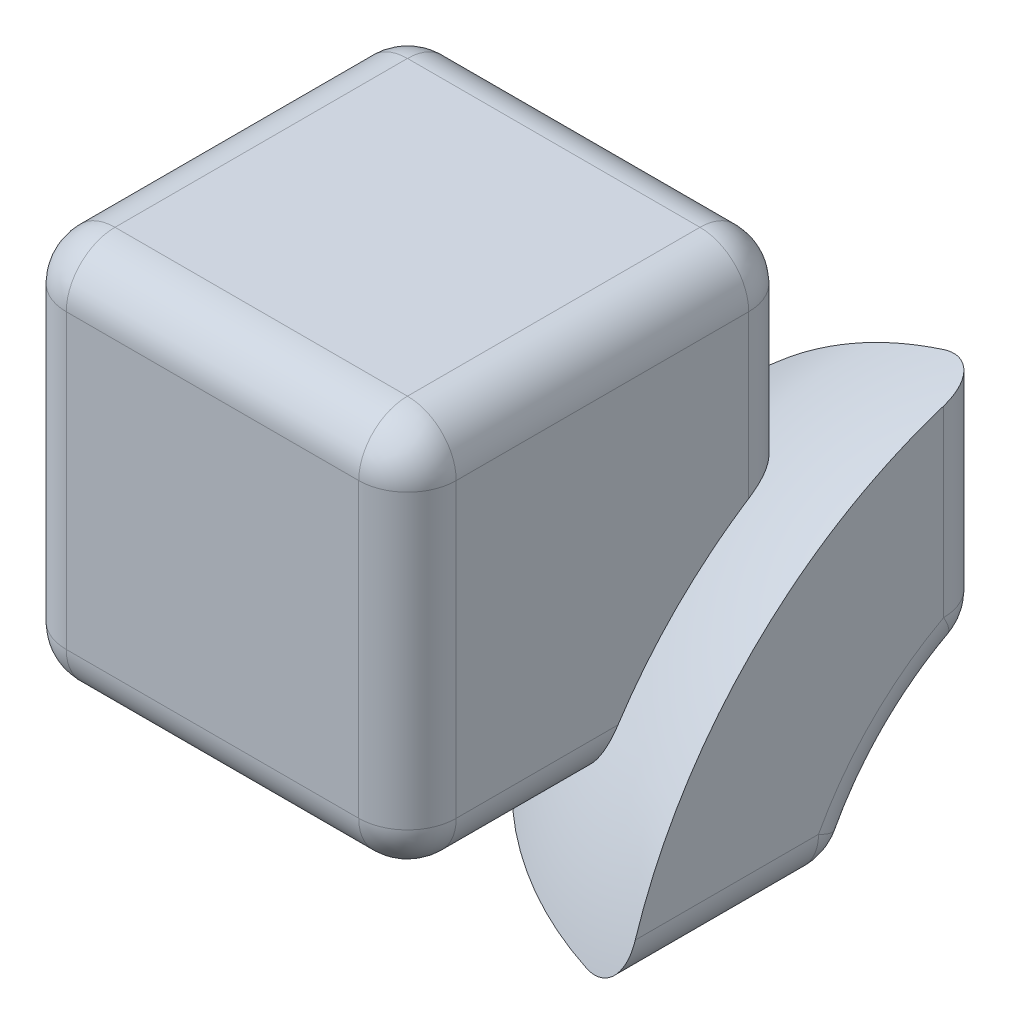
ISO-10303-21;
HEADER;
FILE_DESCRIPTION(('STEP AP214'),'2;1');
FILE_NAME('part.step','',(''),(''),'','','');
FILE_SCHEMA(('AUTOMOTIVE_DESIGN { 1 0 10303 214 1 1 1 1 }'));
ENDSEC;
DATA;
#1=APPLICATION_CONTEXT('core data for automotive mechanical design processes');
#2=APPLICATION_PROTOCOL_DEFINITION('international standard','automotive_design',2000,#1);
#3=PRODUCT_CONTEXT('',#1,'mechanical');
#4=PRODUCT('Part','Part','',(#3));
#5=PRODUCT_RELATED_PRODUCT_CATEGORY('part','',(#4));
#6=PRODUCT_DEFINITION_FORMATION('','',#4);
#7=PRODUCT_DEFINITION_CONTEXT('part definition',#1,'design');
#8=PRODUCT_DEFINITION('design','',#6,#7);
#9=PRODUCT_DEFINITION_SHAPE('','',#8);
#10=(LENGTH_UNIT() NAMED_UNIT(*) SI_UNIT(.MILLI.,.METRE.));
#11=(NAMED_UNIT(*) PLANE_ANGLE_UNIT() SI_UNIT($,.RADIAN.));
#12=(NAMED_UNIT(*) SI_UNIT($,.STERADIAN.) SOLID_ANGLE_UNIT());
#13=UNCERTAINTY_MEASURE_WITH_UNIT(LENGTH_MEASURE(1.E-05),#10,'distance_accuracy_value','');
#14=(GEOMETRIC_REPRESENTATION_CONTEXT(3) GLOBAL_UNCERTAINTY_ASSIGNED_CONTEXT((#13)) GLOBAL_UNIT_ASSIGNED_CONTEXT((#10,
#11,#12)) REPRESENTATION_CONTEXT('',''));
#15=CARTESIAN_POINT('',(0.,0.,0.));
#16=DIRECTION('',(0.,0.,1.));
#17=DIRECTION('',(1.,0.,0.));
#18=AXIS2_PLACEMENT_3D('',#15,#16,#17);
#19=CARTESIAN_POINT('',(-9.00135131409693,9.12854604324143,9.00135264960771));
#20=DIRECTION('',(0.,1.,0.));
#21=DIRECTION('',(0.,0.,1.));
#22=AXIS2_PLACEMENT_3D('',#19,#20,#21);
#23=SPHERICAL_SURFACE('',#22,37.5);
#24=CARTESIAN_POINT('',(-24.0013513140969,9.12854604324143,9.00135264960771));
#25=DIRECTION('',(-1.,0.,0.));
#26=DIRECTION('',(0.,-1.,0.));
#27=AXIS2_PLACEMENT_3D('',#24,#25,#26);
#28=CIRCLE('',#27,34.3693177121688);
#29=CARTESIAN_POINT('',(-24.0013513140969,37.9328425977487,27.7513526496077));
#30=VERTEX_POINT('',#29);
#31=CARTESIAN_POINT('',(-24.0013513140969,27.8785460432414,37.805649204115));
#32=VERTEX_POINT('',#31);
#33=EDGE_CURVE('E544',#30,#32,#28,.F.);
#34=ORIENTED_EDGE('',*,*,#33,.T.);
#35=CARTESIAN_POINT('',(-24.0013513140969,27.8785460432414,37.805649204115));
#36=CARTESIAN_POINT('',(-24.0013597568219,27.7908915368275,37.8627026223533));
#37=CARTESIAN_POINT('',(-24.004427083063,27.7022656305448,37.9182261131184));
#38=CARTESIAN_POINT('',(-24.0171361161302,27.523269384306,38.0258481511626));
#39=CARTESIAN_POINT('',(-24.0267863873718,27.4328969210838,38.0779421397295));
#40=CARTESIAN_POINT('',(-24.0664415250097,27.1587386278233,38.2289000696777));
#41=CARTESIAN_POINT('',(-24.1071617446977,26.9729479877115,38.3217597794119));
#42=CARTESIAN_POINT('',(-24.2112043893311,26.6309443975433,38.4735077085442));
#43=CARTESIAN_POINT('',(-24.2699253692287,26.4747075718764,38.5354470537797));
#44=CARTESIAN_POINT('',(-24.3752945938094,26.243952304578,38.614906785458));
#45=CARTESIAN_POINT('',(-24.4132588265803,26.1676980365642,38.6391367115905));
#46=CARTESIAN_POINT('',(-24.4949363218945,26.0169339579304,38.6828114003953));
#47=CARTESIAN_POINT('',(-24.538647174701,25.942423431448,38.7022581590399));
#48=CARTESIAN_POINT('',(-24.6320498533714,25.7952525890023,38.7361823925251));
#49=CARTESIAN_POINT('',(-24.6817837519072,25.7226101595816,38.7506218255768));
#50=CARTESIAN_POINT('',(-24.786688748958,25.5804874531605,38.7740697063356));
#51=CARTESIAN_POINT('',(-24.8418573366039,25.5110057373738,38.7830806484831));
#52=CARTESIAN_POINT('',(-24.9573031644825,25.375808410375,38.7955132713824));
#53=CARTESIAN_POINT('',(-25.0175834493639,25.3100950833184,38.7989315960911));
#54=CARTESIAN_POINT('',(-25.1426793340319,25.183126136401,38.8001100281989));
#55=CARTESIAN_POINT('',(-25.207494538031,25.121870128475,38.7978706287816));
#56=CARTESIAN_POINT('',(-25.3939847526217,24.9578206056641,38.7837478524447));
#57=CARTESIAN_POINT('',(-25.5201022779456,24.8604733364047,38.7656399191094));
#58=CARTESIAN_POINT('',(-25.7809483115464,24.6840411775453,38.712415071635));
#59=CARTESIAN_POINT('',(-25.9156732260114,24.6049487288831,38.6773052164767));
#60=CARTESIAN_POINT('',(-26.1934254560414,24.4638350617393,38.5908488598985));
#61=CARTESIAN_POINT('',(-26.3365770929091,24.4023038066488,38.5391089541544));
#62=CARTESIAN_POINT('',(-26.6244750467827,24.2985844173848,38.4219636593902));
#63=CARTESIAN_POINT('',(-26.7692236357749,24.2564288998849,38.3565354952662));
#64=CARTESIAN_POINT('',(-27.0559657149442,24.1906734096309,38.2150414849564));
#65=CARTESIAN_POINT('',(-27.1979722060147,24.1669161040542,38.1390725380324));
#66=CARTESIAN_POINT('',(-27.4779531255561,24.1358859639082,37.9784333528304));
#67=CARTESIAN_POINT('',(-27.6159437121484,24.1285340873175,37.8938069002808));
#68=CARTESIAN_POINT('',(-27.7513513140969,24.1285460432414,37.805649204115));
#69=B_SPLINE_CURVE_WITH_KNOTS('',3,(#35,#36,#37,#38,#39,#40,#41,#42,#43,#44,#45,#46,#47,#48,#49,
#50,#51,#52,#53,#54,#55,#56,#57,#58,#59,#60,#61,#62,#63,#64,#65,#66,#67,#68),.UNSPECIFIED.,.F.,
.F.,(4,2,2,2,2,2,2,2,2,2,2,2,2,2,2,2,4),(0.,0.3136389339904,0.627686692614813,1.25946339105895,
1.79117444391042,2.05657299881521,2.32186061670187,2.58912166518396,2.85625981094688,
3.12355820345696,3.39083329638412,3.86940559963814,4.34777937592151,4.83842456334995,
5.32989269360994,5.81711013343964,6.30197502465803),.UNSPECIFIED.);
#70=CARTESIAN_POINT('',(-27.7513513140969,24.1285460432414,37.805649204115));
#71=VERTEX_POINT('',#70);
#72=EDGE_CURVE('E344',#32,#71,#69,.T.);
#73=ORIENTED_EDGE('',*,*,#72,.T.);
#74=CARTESIAN_POINT('',(-9.00135131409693,24.1285460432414,9.00135264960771));
#75=DIRECTION('',(0.,1.,0.));
#76=DIRECTION('',(-1.,0.,0.));
#77=AXIS2_PLACEMENT_3D('',#74,#75,#76);
#78=CIRCLE('',#77,34.3693177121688);
#79=CARTESIAN_POINT('',(-37.8056478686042,24.1285460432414,27.7513526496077));
#80=VERTEX_POINT('',#79);
#81=EDGE_CURVE('E562',#71,#80,#78,.F.);
#82=ORIENTED_EDGE('',*,*,#81,.T.);
#83=CARTESIAN_POINT('',(-37.8056478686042,24.1285460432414,27.7513526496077));
#84=CARTESIAN_POINT('',(-37.8627012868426,24.1285544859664,27.6636981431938));
#85=CARTESIAN_POINT('',(-37.9182247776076,24.1316218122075,27.5750722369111));
#86=CARTESIAN_POINT('',(-38.0258468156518,24.1443308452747,27.3960759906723));
#87=CARTESIAN_POINT('',(-38.0779408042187,24.1539811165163,27.3057035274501));
#88=CARTESIAN_POINT('',(-38.2288987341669,24.1936362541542,27.0315452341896));
#89=CARTESIAN_POINT('',(-38.3217584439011,24.2343564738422,26.8457545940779));
#90=CARTESIAN_POINT('',(-38.4735063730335,24.3383991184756,26.5037510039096));
#91=CARTESIAN_POINT('',(-38.5354457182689,24.3971200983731,26.3475141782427));
#92=CARTESIAN_POINT('',(-38.6149054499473,24.5024893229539,26.1167589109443));
#93=CARTESIAN_POINT('',(-38.6391353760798,24.5404535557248,26.0405046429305));
#94=CARTESIAN_POINT('',(-38.6828100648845,24.622131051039,25.8897405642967));
#95=CARTESIAN_POINT('',(-38.7022568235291,24.6658419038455,25.8152300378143));
#96=CARTESIAN_POINT('',(-38.7361810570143,24.7592445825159,25.6680591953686));
#97=CARTESIAN_POINT('',(-38.750620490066,24.8089784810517,25.5954167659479));
#98=CARTESIAN_POINT('',(-38.7740683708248,24.9138834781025,25.4532940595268));
#99=CARTESIAN_POINT('',(-38.7830793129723,24.9690520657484,25.3838123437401));
#100=CARTESIAN_POINT('',(-38.7955119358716,25.084497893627,25.2486150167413));
#101=CARTESIAN_POINT('',(-38.7989302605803,25.1447781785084,25.1829016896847));
#102=CARTESIAN_POINT('',(-38.8001086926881,25.2698740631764,25.0559327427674));
#103=CARTESIAN_POINT('',(-38.7978692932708,25.3346892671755,24.9946767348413));
#104=CARTESIAN_POINT('',(-38.7837465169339,25.5211794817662,24.8306272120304));
#105=CARTESIAN_POINT('',(-38.7656385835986,25.6472970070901,24.733279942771));
#106=CARTESIAN_POINT('',(-38.7124137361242,25.9081430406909,24.5568477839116));
#107=CARTESIAN_POINT('',(-38.6773038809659,26.0428679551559,24.4777553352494));
#108=CARTESIAN_POINT('',(-38.5908475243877,26.3206201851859,24.3366416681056));
#109=CARTESIAN_POINT('',(-38.5391076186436,26.4637718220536,24.2751104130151));
#110=CARTESIAN_POINT('',(-38.4219623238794,26.7516697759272,24.1713910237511));
#111=CARTESIAN_POINT('',(-38.3565341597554,26.8964183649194,24.1292355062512));
#112=CARTESIAN_POINT('',(-38.2150401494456,27.1831604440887,24.0634800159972));
#113=CARTESIAN_POINT('',(-38.1390712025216,27.3251669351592,24.0397227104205));
#114=CARTESIAN_POINT('',(-37.9784320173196,27.6051478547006,24.0086925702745));
#115=CARTESIAN_POINT('',(-37.89380556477,27.7431384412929,24.0013406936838));
#116=CARTESIAN_POINT('',(-37.8056478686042,27.8785460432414,24.0013526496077));
#117=B_SPLINE_CURVE_WITH_KNOTS('',3,(#83,#84,#85,#86,#87,#88,#89,#90,#91,#92,#93,#94,#95,#96,
#97,#98,#99,#100,#101,#102,#103,#104,#105,#106,#107,#108,#109,#110,#111,#112,#113,#114,#115,
#116),.UNSPECIFIED.,.F.,.F.,(4,2,2,2,2,2,2,2,2,2,2,2,2,2,2,2,4),(0.,0.313638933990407,
0.627686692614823,1.25946339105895,1.79117444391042,2.05657299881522,2.32186061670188,
2.58912166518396,2.85625981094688,3.12355820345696,3.39083329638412,3.86940559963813,
4.34777937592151,4.83842456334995,5.32989269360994,5.81711013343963,6.30197502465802),.UNSPECIFIED.);
#118=CARTESIAN_POINT('',(-37.8056478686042,27.8785460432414,24.0013526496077));
#119=VERTEX_POINT('',#118);
#120=EDGE_CURVE('E335',#80,#119,#117,.T.);
#121=ORIENTED_EDGE('',*,*,#120,.T.);
#122=CARTESIAN_POINT('',(-9.00135131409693,9.12854604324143,24.0013526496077));
#123=DIRECTION('',(0.,0.,1.));
#124=DIRECTION('',(1.,0.,0.));
#125=AXIS2_PLACEMENT_3D('',#122,#123,#124);
#126=CIRCLE('',#125,34.3693177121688);
#127=CARTESIAN_POINT('',(-27.7513513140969,37.9328425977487,24.0013526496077));
#128=VERTEX_POINT('',#127);
#129=EDGE_CURVE('E667',#119,#128,#126,.F.);
#130=ORIENTED_EDGE('',*,*,#129,.T.);
#131=CARTESIAN_POINT('',(-27.7513513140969,37.9328425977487,24.0013526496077));
#132=CARTESIAN_POINT('',(-27.663696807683,37.989896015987,24.0013610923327));
#133=CARTESIAN_POINT('',(-27.5750709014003,38.0454195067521,24.0044284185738));
#134=CARTESIAN_POINT('',(-27.3960746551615,38.1530415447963,24.017137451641));
#135=CARTESIAN_POINT('',(-27.3057021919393,38.2051355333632,24.0267877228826));
#136=CARTESIAN_POINT('',(-27.0315438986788,38.3560934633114,24.0664428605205));
#137=CARTESIAN_POINT('',(-26.8457532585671,38.4489531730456,24.1071630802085));
#138=CARTESIAN_POINT('',(-26.5037496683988,38.6007011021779,24.2112057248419));
#139=CARTESIAN_POINT('',(-26.3475128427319,38.6626404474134,24.2699267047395));
#140=CARTESIAN_POINT('',(-26.1167575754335,38.7421001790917,24.3752959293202));
#141=CARTESIAN_POINT('',(-26.0405033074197,38.7663301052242,24.4132601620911));
#142=CARTESIAN_POINT('',(-25.8897392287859,38.810004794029,24.4949376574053));
#143=CARTESIAN_POINT('',(-25.8152287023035,38.8294515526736,24.5386485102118));
#144=CARTESIAN_POINT('',(-25.6680578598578,38.8633757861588,24.6320511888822));
#145=CARTESIAN_POINT('',(-25.5954154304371,38.8778152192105,24.681785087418));
#146=CARTESIAN_POINT('',(-25.453292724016,38.9012630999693,24.7866900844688));
#147=CARTESIAN_POINT('',(-25.3838110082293,38.9102740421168,24.8418586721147));
#148=CARTESIAN_POINT('',(-25.2486136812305,38.9227066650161,24.9573044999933));
#149=CARTESIAN_POINT('',(-25.1829003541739,38.9261249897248,25.0175847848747));
#150=CARTESIAN_POINT('',(-25.0559314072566,38.9273034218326,25.1426806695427));
#151=CARTESIAN_POINT('',(-24.9946753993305,38.9250640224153,25.2074958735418));
#152=CARTESIAN_POINT('',(-24.8306258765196,38.9109412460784,25.3939860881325));
#153=CARTESIAN_POINT('',(-24.7332786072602,38.8928333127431,25.5201036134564));
#154=CARTESIAN_POINT('',(-24.5568464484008,38.8396084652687,25.7809496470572));
#155=CARTESIAN_POINT('',(-24.4777539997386,38.8044986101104,25.9156745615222));
#156=CARTESIAN_POINT('',(-24.3366403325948,38.7180422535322,26.1934267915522));
#157=CARTESIAN_POINT('',(-24.2751090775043,38.6663023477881,26.3365784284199));
#158=CARTESIAN_POINT('',(-24.1713896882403,38.5491570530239,26.6244763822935));
#159=CARTESIAN_POINT('',(-24.1292341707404,38.4837288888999,26.7692249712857));
#160=CARTESIAN_POINT('',(-24.0634786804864,38.3422348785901,27.055967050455));
#161=CARTESIAN_POINT('',(-24.0397213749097,38.2662659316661,27.1979735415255));
#162=CARTESIAN_POINT('',(-24.0086912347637,38.1056267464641,27.4779544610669));
#163=CARTESIAN_POINT('',(-24.001339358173,38.0210002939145,27.6159450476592));
#164=CARTESIAN_POINT('',(-24.0013513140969,37.9328425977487,27.7513526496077));
#165=B_SPLINE_CURVE_WITH_KNOTS('',3,(#131,#132,#133,#134,#135,#136,#137,#138,#139,#140,#141,
#142,#143,#144,#145,#146,#147,#148,#149,#150,#151,#152,#153,#154,#155,#156,#157,#158,#159,#160,
#161,#162,#163,#164),.UNSPECIFIED.,.F.,.F.,(4,2,2,2,2,2,2,2,2,2,2,2,2,2,2,2,4),(0.,
0.313638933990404,0.627686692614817,1.25946339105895,1.79117444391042,2.05657299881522,
2.32186061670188,2.58912166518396,2.85625981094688,3.12355820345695,3.39083329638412,
3.86940559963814,4.34777937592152,4.83842456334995,5.32989269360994,5.81711013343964,
6.30197502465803),.UNSPECIFIED.);
#166=EDGE_CURVE('E351',#128,#30,#165,.T.);
#167=ORIENTED_EDGE('',*,*,#166,.T.);
#168=EDGE_LOOP('',(#34,#73,#82,#121,#130,#167));
#169=FACE_BOUND('',#168,.T.);
#170=CARTESIAN_POINT('',(-9.00135131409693,16.6285460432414,9.00135264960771));
#171=DIRECTION('',(0.,-1.,0.));
#172=DIRECTION('',(0.,0.,-1.));
#173=AXIS2_PLACEMENT_3D('',#170,#171,#172);
#174=CIRCLE('',#173,36.7423461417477);
#175=CARTESIAN_POINT('',(-43.97902276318,16.6285460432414,20.2513526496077));
#176=VERTEX_POINT('',#175);
#177=CARTESIAN_POINT('',(-20.2513513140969,16.6285460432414,43.9790240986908));
#178=VERTEX_POINT('',#177);
#179=EDGE_CURVE('E452',#176,#178,#174,.F.);
#180=ORIENTED_EDGE('',*,*,#179,.T.);
#181=CARTESIAN_POINT('',(-20.2513513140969,16.6285460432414,43.9790240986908));
#182=CARTESIAN_POINT('',(-20.1526507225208,16.6285364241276,44.0107727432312));
#183=CARTESIAN_POINT('',(-20.053556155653,16.6324427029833,44.0413451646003));
#184=CARTESIAN_POINT('',(-19.8552029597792,16.6482042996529,44.0999193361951));
#185=CARTESIAN_POINT('',(-19.7559442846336,16.660062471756,44.1279201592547));
#186=CARTESIAN_POINT('',(-19.5577649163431,16.6918763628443,44.1811618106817));
#187=CARTESIAN_POINT('',(-19.4588452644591,16.7118478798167,44.2063971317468));
#188=CARTESIAN_POINT('',(-19.262267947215,16.759920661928,44.2538207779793));
#189=CARTESIAN_POINT('',(-19.1646101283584,16.788020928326,44.276009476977));
#190=CARTESIAN_POINT('',(-18.9710527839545,16.8523919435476,44.317186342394));
#191=CARTESIAN_POINT('',(-18.8751581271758,16.888682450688,44.3361665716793));
#192=CARTESIAN_POINT('',(-18.6861099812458,16.9692819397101,44.3706779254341));
#193=CARTESIAN_POINT('',(-18.592957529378,17.0135939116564,44.3862077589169));
#194=CARTESIAN_POINT('',(-18.4103540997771,17.1099272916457,44.4136251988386));
#195=CARTESIAN_POINT('',(-18.320897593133,17.1619366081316,44.4255184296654));
#196=CARTESIAN_POINT('',(-18.1462674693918,17.2734123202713,44.4455693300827));
#197=CARTESIAN_POINT('',(-18.0610953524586,17.3328813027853,44.4537256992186));
#198=CARTESIAN_POINT('',(-17.8998809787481,17.4557312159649,44.4658976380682));
#199=CARTESIAN_POINT('',(-17.8235956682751,17.5187752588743,44.4700973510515));
#200=CARTESIAN_POINT('',(-17.6761603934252,17.6507837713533,44.4749900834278));
#201=CARTESIAN_POINT('',(-17.6050123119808,17.7197503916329,44.4756818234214));
#202=CARTESIAN_POINT('',(-17.4684510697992,17.863043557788,44.4735468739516));
#203=CARTESIAN_POINT('',(-17.4030353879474,17.9373677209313,44.4707217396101));
#204=CARTESIAN_POINT('',(-17.2783663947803,18.0908284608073,44.4615884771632));
#205=CARTESIAN_POINT('',(-17.2191152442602,18.169966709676,44.4552791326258));
#206=CARTESIAN_POINT('',(-17.0542859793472,18.409276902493,44.4316403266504));
#207=CARTESIAN_POINT('',(-16.9578069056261,18.5753895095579,44.4095307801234));
#208=CARTESIAN_POINT('',(-16.7918798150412,18.9187627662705,44.3531067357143));
#209=CARTESIAN_POINT('',(-16.7224516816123,19.0960315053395,44.3187832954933));
#210=CARTESIAN_POINT('',(-16.6392217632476,19.3666186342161,44.2590351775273));
#211=CARTESIAN_POINT('',(-16.6149396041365,19.4577597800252,44.2376970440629));
#212=CARTESIAN_POINT('',(-16.573393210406,19.6410216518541,44.1924221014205));
#213=CARTESIAN_POINT('',(-16.5561296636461,19.7331424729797,44.1684850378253));
#214=CARTESIAN_POINT('',(-16.5286190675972,19.9176223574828,44.1182344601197));
#215=CARTESIAN_POINT('',(-16.5183617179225,20.0099808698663,44.091924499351));
#216=CARTESIAN_POINT('',(-16.5047257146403,20.1945204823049,44.0370901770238));
#217=CARTESIAN_POINT('',(-16.5013450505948,20.2867016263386,44.0085664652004));
#218=CARTESIAN_POINT('',(-16.5013513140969,20.3785460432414,43.9790240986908));
#219=B_SPLINE_CURVE_WITH_KNOTS('',3,(#181,#182,#183,#184,#185,#186,#187,#188,#189,#190,#191,
#192,#193,#194,#195,#196,#197,#198,#199,#200,#201,#202,#203,#204,#205,#206,#207,#208,#209,#210,
#211,#212,#213,#214,#215,#216,#217,#218),.UNSPECIFIED.,.F.,.F.,(4,2,2,2,2,2,2,2,2,2,2,2,2,2,2,2,
2,2,4),(0.,0.310984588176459,0.622080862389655,0.933785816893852,1.24545248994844,
1.55787922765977,1.87042266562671,2.18248024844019,2.49464634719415,2.79143895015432,
3.08833978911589,3.38510938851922,3.6819826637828,4.25924404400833,4.83692893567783,
5.12679480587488,5.4166890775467,5.70615622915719,5.99553874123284),.UNSPECIFIED.);
#220=CARTESIAN_POINT('',(-16.5013513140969,20.3785460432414,43.9790240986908));
#221=VERTEX_POINT('',#220);
#222=EDGE_CURVE('E12',#178,#221,#219,.T.);
#223=ORIENTED_EDGE('',*,*,#222,.T.);
#224=CARTESIAN_POINT('',(-16.5013513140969,9.12854604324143,9.00135264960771));
#225=DIRECTION('',(-1.,0.,0.));
#226=DIRECTION('',(0.,0.,1.));
#227=AXIS2_PLACEMENT_3D('',#224,#225,#226);
#228=CIRCLE('',#227,36.7423461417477);
#229=CARTESIAN_POINT('',(-16.5013513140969,44.1062174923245,20.2513526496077));
#230=VERTEX_POINT('',#229);
#231=EDGE_CURVE('E445',#230,#221,#228,.F.);
#232=ORIENTED_EDGE('',*,*,#231,.F.);
#233=CARTESIAN_POINT('',(-16.5013513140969,44.1062174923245,20.2513526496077));
#234=CARTESIAN_POINT('',(-16.5013416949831,44.1379661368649,20.1526520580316));
#235=CARTESIAN_POINT('',(-16.5052479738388,44.168538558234,20.0535574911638));
#236=CARTESIAN_POINT('',(-16.5210095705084,44.2271127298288,19.85520429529));
#237=CARTESIAN_POINT('',(-16.5328677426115,44.2551135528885,19.7559456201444));
#238=CARTESIAN_POINT('',(-16.5646816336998,44.3083552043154,19.5577662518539));
#239=CARTESIAN_POINT('',(-16.5846531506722,44.3335905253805,19.4588465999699));
#240=CARTESIAN_POINT('',(-16.6327259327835,44.381014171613,19.2622692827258));
#241=CARTESIAN_POINT('',(-16.6608261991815,44.4032028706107,19.1646114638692));
#242=CARTESIAN_POINT('',(-16.7251972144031,44.4443797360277,18.9710541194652));
#243=CARTESIAN_POINT('',(-16.7614877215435,44.463359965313,18.8751594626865));
#244=CARTESIAN_POINT('',(-16.8420872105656,44.4978713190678,18.6861113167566));
#245=CARTESIAN_POINT('',(-16.8863991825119,44.5134011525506,18.5929588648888));
#246=CARTESIAN_POINT('',(-16.9827325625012,44.5408185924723,18.4103554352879));
#247=CARTESIAN_POINT('',(-17.0347418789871,44.5527118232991,18.3208989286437));
#248=CARTESIAN_POINT('',(-17.1462175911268,44.5727627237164,18.1462688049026));
#249=CARTESIAN_POINT('',(-17.2056865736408,44.5809190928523,18.0610966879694));
#250=CARTESIAN_POINT('',(-17.3285364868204,44.5930910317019,17.8998823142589));
#251=CARTESIAN_POINT('',(-17.3915805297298,44.5972907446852,17.8235970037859));
#252=CARTESIAN_POINT('',(-17.5235890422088,44.6021834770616,17.676161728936));
#253=CARTESIAN_POINT('',(-17.5925556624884,44.6028752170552,17.6050136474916));
#254=CARTESIAN_POINT('',(-17.7358488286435,44.6007402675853,17.46845240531));
#255=CARTESIAN_POINT('',(-17.8101729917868,44.5979151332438,17.4030367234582));
#256=CARTESIAN_POINT('',(-17.9636337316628,44.5887818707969,17.2783677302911));
#257=CARTESIAN_POINT('',(-18.0427719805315,44.5824725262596,17.219116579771));
#258=CARTESIAN_POINT('',(-18.2820821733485,44.5588337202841,17.054287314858));
#259=CARTESIAN_POINT('',(-18.4481947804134,44.5367241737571,16.9578082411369));
#260=CARTESIAN_POINT('',(-18.791568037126,44.480300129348,16.791881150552));
#261=CARTESIAN_POINT('',(-18.968836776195,44.445976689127,16.7224530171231));
#262=CARTESIAN_POINT('',(-19.2394239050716,44.3862285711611,16.6392230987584));
#263=CARTESIAN_POINT('',(-19.3305650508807,44.3648904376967,16.6149409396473));
#264=CARTESIAN_POINT('',(-19.5138269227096,44.3196154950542,16.5733945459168));
#265=CARTESIAN_POINT('',(-19.6059477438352,44.295678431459,16.5561309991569));
#266=CARTESIAN_POINT('',(-19.7904276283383,44.2454278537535,16.528620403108));
#267=CARTESIAN_POINT('',(-19.8827861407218,44.2191178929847,16.5183630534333));
#268=CARTESIAN_POINT('',(-20.0673257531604,44.1642835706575,16.5047270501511));
#269=CARTESIAN_POINT('',(-20.1595068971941,44.1357598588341,16.5013463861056));
#270=CARTESIAN_POINT('',(-20.2513513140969,44.1062174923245,16.5013526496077));
#271=B_SPLINE_CURVE_WITH_KNOTS('',3,(#233,#234,#235,#236,#237,#238,#239,#240,#241,#242,#243,
#244,#245,#246,#247,#248,#249,#250,#251,#252,#253,#254,#255,#256,#257,#258,#259,#260,#261,#262,
#263,#264,#265,#266,#267,#268,#269,#270),.UNSPECIFIED.,.F.,.F.,(4,2,2,2,2,2,2,2,2,2,2,2,2,2,2,2,
2,2,4),(0.,0.310984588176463,0.622080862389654,0.933785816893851,1.24545248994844,
1.55787922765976,1.87042266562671,2.18248024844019,2.49464634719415,2.79143895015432,
3.08833978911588,3.38510938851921,3.6819826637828,4.25924404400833,4.83692893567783,
5.12679480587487,5.4166890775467,5.70615622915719,5.99553874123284),.UNSPECIFIED.);
#272=CARTESIAN_POINT('',(-20.2513513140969,44.1062174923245,16.5013526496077));
#273=VERTEX_POINT('',#272);
#274=EDGE_CURVE('E358',#230,#273,#271,.T.);
#275=ORIENTED_EDGE('',*,*,#274,.T.);
#276=CARTESIAN_POINT('',(-9.00135131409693,9.12854604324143,16.5013526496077));
#277=DIRECTION('',(0.,0.,1.));
#278=DIRECTION('',(1.,0.,0.));
#279=AXIS2_PLACEMENT_3D('',#276,#277,#278);
#280=CIRCLE('',#279,36.7423461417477);
#281=CARTESIAN_POINT('',(-43.97902276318,20.3785460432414,16.5013526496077));
#282=VERTEX_POINT('',#281);
#283=EDGE_CURVE('E443',#282,#273,#280,.F.);
#284=ORIENTED_EDGE('',*,*,#283,.F.);
#285=CARTESIAN_POINT('',(-43.97902276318,20.3785460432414,16.5013526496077));
#286=CARTESIAN_POINT('',(-44.0107714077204,20.2798454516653,16.5013430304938));
#287=CARTESIAN_POINT('',(-44.0413438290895,20.1807508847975,16.5052493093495));
#288=CARTESIAN_POINT('',(-44.0999180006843,19.9823976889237,16.5210109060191));
#289=CARTESIAN_POINT('',(-44.127918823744,19.8831390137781,16.5328690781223));
#290=CARTESIAN_POINT('',(-44.1811604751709,19.6849596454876,16.5646829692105));
#291=CARTESIAN_POINT('',(-44.206395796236,19.5860399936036,16.584654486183));
#292=CARTESIAN_POINT('',(-44.2538194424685,19.3894626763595,16.6327272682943));
#293=CARTESIAN_POINT('',(-44.2760081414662,19.2918048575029,16.6608275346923));
#294=CARTESIAN_POINT('',(-44.3171850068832,19.098247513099,16.7251985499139));
#295=CARTESIAN_POINT('',(-44.3361652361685,19.0023528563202,16.7614890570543));
#296=CARTESIAN_POINT('',(-44.3706765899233,18.8133047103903,16.8420885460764));
#297=CARTESIAN_POINT('',(-44.3862064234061,18.7201522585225,16.8864005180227));
#298=CARTESIAN_POINT('',(-44.4136238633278,18.5375488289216,16.982733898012));
#299=CARTESIAN_POINT('',(-44.4255170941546,18.4480923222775,17.0347432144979));
#300=CARTESIAN_POINT('',(-44.4455679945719,18.2734621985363,17.1462189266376));
#301=CARTESIAN_POINT('',(-44.4537243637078,18.1882900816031,17.2056879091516));
#302=CARTESIAN_POINT('',(-44.4658963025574,18.0270757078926,17.3285378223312));
#303=CARTESIAN_POINT('',(-44.4700960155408,17.9507903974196,17.3915818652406));
#304=CARTESIAN_POINT('',(-44.4749887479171,17.8033551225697,17.5235903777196));
#305=CARTESIAN_POINT('',(-44.4756804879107,17.7322070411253,17.5925569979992));
#306=CARTESIAN_POINT('',(-44.4735455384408,17.5956457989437,17.7358501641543));
#307=CARTESIAN_POINT('',(-44.4707204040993,17.5302301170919,17.8101743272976));
#308=CARTESIAN_POINT('',(-44.4615871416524,17.4055611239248,17.9636350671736));
#309=CARTESIAN_POINT('',(-44.4552777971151,17.3463099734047,18.0427733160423));
#310=CARTESIAN_POINT('',(-44.4316389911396,17.1814807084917,18.2820835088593));
#311=CARTESIAN_POINT('',(-44.4095294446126,17.0850016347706,18.4481961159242));
#312=CARTESIAN_POINT('',(-44.3531054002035,16.9190745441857,18.7915693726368));
#313=CARTESIAN_POINT('',(-44.3187819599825,16.8496464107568,18.9688381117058));
#314=CARTESIAN_POINT('',(-44.2590338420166,16.7664164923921,19.2394252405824));
#315=CARTESIAN_POINT('',(-44.2376957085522,16.742134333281,19.3305663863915));
#316=CARTESIAN_POINT('',(-44.1924207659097,16.7005879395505,19.5138282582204));
#317=CARTESIAN_POINT('',(-44.1684837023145,16.6833243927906,19.605949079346));
#318=CARTESIAN_POINT('',(-44.118233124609,16.6558137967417,19.7904289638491));
#319=CARTESIAN_POINT('',(-44.0919231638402,16.645556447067,19.8827874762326));
#320=CARTESIAN_POINT('',(-44.037088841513,16.6319204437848,20.0673270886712));
#321=CARTESIAN_POINT('',(-44.0085651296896,16.6285397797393,20.1595082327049));
#322=CARTESIAN_POINT('',(-43.97902276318,16.6285460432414,20.2513526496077));
#323=B_SPLINE_CURVE_WITH_KNOTS('',3,(#285,#286,#287,#288,#289,#290,#291,#292,#293,#294,#295,
#296,#297,#298,#299,#300,#301,#302,#303,#304,#305,#306,#307,#308,#309,#310,#311,#312,#313,#314,
#315,#316,#317,#318,#319,#320,#321,#322),.UNSPECIFIED.,.F.,.F.,(4,2,2,2,2,2,2,2,2,2,2,2,2,2,2,2,
2,2,4),(0.,0.310984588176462,0.622080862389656,0.933785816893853,1.24545248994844,
1.55787922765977,1.87042266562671,2.18248024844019,2.49464634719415,2.79143895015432,
3.08833978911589,3.38510938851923,3.6819826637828,4.25924404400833,4.83692893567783,
5.12679480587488,5.4166890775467,5.70615622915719,5.99553874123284),.UNSPECIFIED.);
#324=EDGE_CURVE('E95',#282,#176,#323,.T.);
#325=ORIENTED_EDGE('',*,*,#324,.T.);
#326=EDGE_LOOP('',(#180,#223,#232,#275,#284,#325));
#327=FACE_BOUND('',#326,.T.);
#328=ADVANCED_FACE('F84',(#169,#327),#23,.T.);
#329=CARTESIAN_POINT('',(-16.5013513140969,-28.3714539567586,45.7436987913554));
#330=DIRECTION('',(-1.,0.,0.));
#331=DIRECTION('',(0.,0.,1.));
#332=AXIS2_PLACEMENT_3D('',#329,#330,#331);
#333=PLANE('',#332);
#334=ORIENTED_EDGE('',*,*,#231,.T.);
#335=DIRECTION('',(0.,0.,-1.));
#336=VECTOR('',#335,1.);
#337=CARTESIAN_POINT('',(-16.5013513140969,20.3785460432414,28.8444874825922));
#338=LINE('',#337,#336);
#339=CARTESIAN_POINT('',(-16.5013513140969,20.3785460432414,29.8804690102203));
#340=VERTEX_POINT('',#339);
#341=EDGE_CURVE('E434',#221,#340,#338,.T.);
#342=ORIENTED_EDGE('',*,*,#341,.T.);
#343=CARTESIAN_POINT('',(-16.5013513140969,9.12854604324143,9.00135264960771));
#344=DIRECTION('',(-1.,0.,0.));
#345=DIRECTION('',(0.,0.,1.));
#346=AXIS2_PLACEMENT_3D('',#343,#344,#345);
#347=CIRCLE('',#346,23.7170824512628);
#348=CARTESIAN_POINT('',(-16.5013513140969,30.007662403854,20.2513526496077));
#349=VERTEX_POINT('',#348);
#350=EDGE_CURVE('E433',#340,#349,#347,.T.);
#351=ORIENTED_EDGE('',*,*,#350,.T.);
#352=DIRECTION('',(0.,1.,0.));
#353=VECTOR('',#352,1.);
#354=CARTESIAN_POINT('',(-16.5013513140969,-28.3714539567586,20.2513526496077));
#355=LINE('',#354,#353);
#356=EDGE_CURVE('E431',#349,#230,#355,.T.);
#357=ORIENTED_EDGE('',*,*,#356,.T.);
#358=EDGE_LOOP('',(#334,#342,#351,#357));
#359=FACE_BOUND('',#358,.T.);
#360=ADVANCED_FACE('F318',(#359),#333,.F.);
#361=CARTESIAN_POINT('',(-45.7436974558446,-28.3714539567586,16.5013526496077));
#362=DIRECTION('',(0.,0.,1.));
#363=DIRECTION('',(1.,0.,0.));
#364=AXIS2_PLACEMENT_3D('',#361,#362,#363);
#365=PLANE('',#364);
#366=CARTESIAN_POINT('',(-9.00135131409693,9.12854604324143,16.5013526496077));
#367=DIRECTION('',(0.,0.,1.));
#368=DIRECTION('',(1.,0.,0.));
#369=AXIS2_PLACEMENT_3D('',#366,#367,#368);
#370=CIRCLE('',#369,23.7170824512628);
#371=CARTESIAN_POINT('',(-20.2513513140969,30.007662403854,16.5013526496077));
#372=VERTEX_POINT('',#371);
#373=CARTESIAN_POINT('',(-29.8804676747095,20.3785460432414,16.5013526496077));
#374=VERTEX_POINT('',#373);
#375=EDGE_CURVE('E457',#372,#374,#370,.T.);
#376=ORIENTED_EDGE('',*,*,#375,.T.);
#377=DIRECTION('',(1.,0.,0.));
#378=VECTOR('',#377,1.);
#379=CARTESIAN_POINT('',(-44.9700877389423,20.3785460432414,16.5013526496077));
#380=LINE('',#379,#378);
#381=EDGE_CURVE('E422',#374,#282,#380,.F.);
#382=ORIENTED_EDGE('',*,*,#381,.T.);
#383=ORIENTED_EDGE('',*,*,#283,.T.);
#384=DIRECTION('',(0.,1.,0.));
#385=VECTOR('',#384,1.);
#386=CARTESIAN_POINT('',(-20.2513513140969,-28.3714539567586,16.5013526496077));
#387=LINE('',#386,#385);
#388=EDGE_CURVE('E449',#273,#372,#387,.F.);
#389=ORIENTED_EDGE('',*,*,#388,.T.);
#390=EDGE_LOOP('',(#376,#382,#383,#389));
#391=FACE_BOUND('',#390,.T.);
#392=ADVANCED_FACE('F321',(#391),#365,.F.);
#393=CARTESIAN_POINT('',(-9.00135131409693,9.12854604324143,9.00135264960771));
#394=DIRECTION('',(0.,1.,0.));
#395=DIRECTION('',(0.,0.,-1.));
#396=AXIS2_PLACEMENT_3D('',#393,#394,#395);
#397=SPHERICAL_SURFACE('',#396,22.5);
#398=CARTESIAN_POINT('',(-9.00135131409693,18.7714031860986,9.00135264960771));
#399=DIRECTION('',(0.,-1.,0.));
#400=DIRECTION('',(0.,0.,-1.));
#401=AXIS2_PLACEMENT_3D('',#398,#399,#400);
#402=CIRCLE('',#401,20.3289278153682);
#403=CARTESIAN_POINT('',(-18.6442084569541,18.7714031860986,26.8977381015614));
#404=VERTEX_POINT('',#403);
#405=CARTESIAN_POINT('',(-26.8977367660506,18.7714031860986,18.6442097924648));
#406=VERTEX_POINT('',#405);
#407=EDGE_CURVE('E411',#404,#406,#402,.T.);
#408=ORIENTED_EDGE('',*,*,#407,.T.);
#409=CARTESIAN_POINT('',(-9.00135131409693,9.12854604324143,18.6442097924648));
#410=DIRECTION('',(0.,0.,-1.));
#411=DIRECTION('',(-1.,0.,0.));
#412=AXIS2_PLACEMENT_3D('',#409,#410,#411);
#413=CIRCLE('',#412,20.3289278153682);
#414=CARTESIAN_POINT('',(-18.6442084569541,27.0249314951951,18.6442097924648));
#415=VERTEX_POINT('',#414);
#416=EDGE_CURVE('E417',#406,#415,#413,.T.);
#417=ORIENTED_EDGE('',*,*,#416,.T.);
#418=CARTESIAN_POINT('',(-18.6442084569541,9.12854604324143,9.00135264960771));
#419=DIRECTION('',(1.,0.,0.));
#420=DIRECTION('',(0.,0.,-1.));
#421=AXIS2_PLACEMENT_3D('',#418,#419,#420);
#422=CIRCLE('',#421,20.3289278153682);
#423=EDGE_CURVE('E418',#415,#404,#422,.T.);
#424=ORIENTED_EDGE('',*,*,#423,.T.);
#425=EDGE_LOOP('',(#408,#417,#424));
#426=FACE_BOUND('',#425,.T.);
#427=ADVANCED_FACE('F325',(#426),#397,.F.);
#428=CARTESIAN_POINT('',(-9.00135131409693,24.1285460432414,-35.9986473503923));
#429=DIRECTION('',(0.,1.,0.));
#430=DIRECTION('',(-1.,0.,0.));
#431=AXIS2_PLACEMENT_3D('',#428,#429,#430);
#432=PLANE('',#431);
#433=DIRECTION('',(0.,0.,1.));
#434=VECTOR('',#433,1.);
#435=CARTESIAN_POINT('',(-50.2513513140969,24.1285460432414,-35.9986473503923));
#436=LINE('',#435,#434);
#437=CARTESIAN_POINT('',(-50.2513513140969,24.1285460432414,50.2513526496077));
#438=VERTEX_POINT('',#437);
#439=CARTESIAN_POINT('',(-50.2513513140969,24.1285460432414,27.7513526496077));
#440=VERTEX_POINT('',#439);
#441=EDGE_CURVE('E578',#438,#440,#436,.F.);
#442=ORIENTED_EDGE('',*,*,#441,.T.);
#443=DIRECTION('',(1.,0.,0.));
#444=VECTOR('',#443,1.);
#445=CARTESIAN_POINT('',(-9.00135131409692,24.1285460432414,27.7513526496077));
#446=LINE('',#445,#444);
#447=EDGE_CURVE('E581',#440,#80,#446,.T.);
#448=ORIENTED_EDGE('',*,*,#447,.T.);
#449=ORIENTED_EDGE('',*,*,#81,.F.);
#450=DIRECTION('',(0.,0.,1.));
#451=VECTOR('',#450,1.);
#452=CARTESIAN_POINT('',(-27.7513513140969,24.1285460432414,-35.9986473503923));
#453=LINE('',#452,#451);
#454=CARTESIAN_POINT('',(-27.7513513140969,24.1285460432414,50.2513526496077));
#455=VERTEX_POINT('',#454);
#456=EDGE_CURVE('E574',#71,#455,#453,.T.);
#457=ORIENTED_EDGE('',*,*,#456,.T.);
#458=DIRECTION('',(-1.,0.,0.));
#459=VECTOR('',#458,1.);
#460=CARTESIAN_POINT('',(-54.0013513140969,24.1285460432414,50.2513526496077));
#461=LINE('',#460,#459);
#462=EDGE_CURVE('E576',#455,#438,#461,.T.);
#463=ORIENTED_EDGE('',*,*,#462,.T.);
#464=EDGE_LOOP('',(#442,#448,#449,#457,#463));
#465=FACE_BOUND('',#464,.T.);
#466=DIRECTION('',(-1.,0.,0.));
#467=VECTOR('',#466,1.);
#468=CARTESIAN_POINT('',(-9.00135131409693,24.1285460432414,46.5013526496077));
#469=LINE('',#468,#467);
#470=CARTESIAN_POINT('',(-28.8444861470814,24.1285460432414,46.5013526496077));
#471=VERTEX_POINT('',#470);
#472=CARTESIAN_POINT('',(-46.5013513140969,24.1285460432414,46.5013526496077));
#473=VERTEX_POINT('',#472);
#474=EDGE_CURVE('E673',#471,#473,#469,.T.);
#475=ORIENTED_EDGE('',*,*,#474,.F.);
#476=CARTESIAN_POINT('',(-9.00135131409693,24.1285460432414,9.00135264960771));
#477=DIRECTION('',(0.,1.,0.));
#478=DIRECTION('',(-1.,0.,0.));
#479=AXIS2_PLACEMENT_3D('',#476,#477,#478);
#480=CIRCLE('',#479,42.4264068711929);
#481=CARTESIAN_POINT('',(-46.5013513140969,24.1285460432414,28.8444874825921));
#482=VERTEX_POINT('',#481);
#483=EDGE_CURVE('E670',#482,#471,#480,.T.);
#484=ORIENTED_EDGE('',*,*,#483,.F.);
#485=DIRECTION('',(0.,0.,-1.));
#486=VECTOR('',#485,1.);
#487=CARTESIAN_POINT('',(-46.5013513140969,24.1285460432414,-28.4986473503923));
#488=LINE('',#487,#486);
#489=EDGE_CURVE('E550',#473,#482,#488,.T.);
#490=ORIENTED_EDGE('',*,*,#489,.F.);
#491=EDGE_LOOP('',(#475,#484,#490));
#492=FACE_BOUND('',#491,.T.);
#493=ADVANCED_FACE('F627',(#465,#492),#432,.F.);
#494=CARTESIAN_POINT('',(-24.0013513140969,9.12854604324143,-35.9986473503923));
#495=DIRECTION('',(-1.,0.,0.));
#496=DIRECTION('',(0.,-1.,0.));
#497=AXIS2_PLACEMENT_3D('',#494,#495,#496);
#498=PLANE('',#497);
#499=DIRECTION('',(0.,-1.,0.));
#500=VECTOR('',#499,1.);
#501=CARTESIAN_POINT('',(-24.0013513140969,24.1285460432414,50.2513526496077));
#502=LINE('',#501,#500);
#503=CARTESIAN_POINT('',(-24.0013513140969,50.3785460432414,50.2513526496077));
#504=VERTEX_POINT('',#503);
#505=CARTESIAN_POINT('',(-24.0013513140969,27.8785460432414,50.2513526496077));
#506=VERTEX_POINT('',#505);
#507=EDGE_CURVE('E604',#504,#506,#502,.T.);
#508=ORIENTED_EDGE('',*,*,#507,.T.);
#509=DIRECTION('',(0.,0.,1.));
#510=VECTOR('',#509,1.);
#511=CARTESIAN_POINT('',(-24.0013513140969,27.8785460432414,-35.9986473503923));
#512=LINE('',#511,#510);
#513=EDGE_CURVE('E606',#506,#32,#512,.F.);
#514=ORIENTED_EDGE('',*,*,#513,.T.);
#515=ORIENTED_EDGE('',*,*,#33,.F.);
#516=DIRECTION('',(0.,-1.,0.));
#517=VECTOR('',#516,1.);
#518=CARTESIAN_POINT('',(-24.0013513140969,9.12854604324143,27.7513526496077));
#519=LINE('',#518,#517);
#520=CARTESIAN_POINT('',(-24.0013513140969,50.3785460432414,27.7513526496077));
#521=VERTEX_POINT('',#520);
#522=EDGE_CURVE('E600',#30,#521,#519,.F.);
#523=ORIENTED_EDGE('',*,*,#522,.T.);
#524=DIRECTION('',(0.,0.,1.));
#525=VECTOR('',#524,1.);
#526=CARTESIAN_POINT('',(-24.0013513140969,50.3785460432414,-35.9986473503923));
#527=LINE('',#526,#525);
#528=EDGE_CURVE('E602',#521,#504,#527,.T.);
#529=ORIENTED_EDGE('',*,*,#528,.T.);
#530=EDGE_LOOP('',(#508,#514,#515,#523,#529));
#531=FACE_BOUND('',#530,.T.);
#532=ADVANCED_FACE('F692',(#531),#498,.F.);
#533=CARTESIAN_POINT('',(-46.5013513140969,-28.3714539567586,-28.4986473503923));
#534=DIRECTION('',(-1.,0.,0.));
#535=DIRECTION('',(0.,0.,1.));
#536=AXIS2_PLACEMENT_3D('',#533,#534,#535);
#537=PLANE('',#536);
#538=DIRECTION('',(0.,0.,1.));
#539=VECTOR('',#538,1.);
#540=CARTESIAN_POINT('',(-46.5013513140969,27.8785460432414,-28.4986473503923));
#541=LINE('',#540,#539);
#542=CARTESIAN_POINT('',(-46.5013513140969,27.8785460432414,25.3472236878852));
#543=VERTEX_POINT('',#542);
#544=CARTESIAN_POINT('',(-46.5013513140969,27.8785460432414,37.5221699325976));
#545=VERTEX_POINT('',#544);
#546=EDGE_CURVE('E103',#543,#545,#541,.T.);
#547=ORIENTED_EDGE('',*,*,#546,.T.);
#548=DIRECTION('',(0.,1.,0.));
#549=VECTOR('',#548,1.);
#550=CARTESIAN_POINT('',(-46.5013513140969,50.3785460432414,37.5221699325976));
#551=LINE('',#550,#549);
#552=CARTESIAN_POINT('',(-46.5013513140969,46.6285460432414,37.5221699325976));
#553=VERTEX_POINT('',#552);
#554=EDGE_CURVE('E267',#545,#553,#551,.T.);
#555=ORIENTED_EDGE('',*,*,#554,.T.);
#556=DIRECTION('',(0.,0.,1.));
#557=VECTOR('',#556,1.);
#558=CARTESIAN_POINT('',(-46.5013513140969,46.6285460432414,-28.4986473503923));
#559=LINE('',#558,#557);
#560=CARTESIAN_POINT('',(-46.5013513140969,46.6285460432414,46.5013526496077));
#561=VERTEX_POINT('',#560);
#562=EDGE_CURVE('E547',#553,#561,#559,.T.);
#563=ORIENTED_EDGE('',*,*,#562,.T.);
#564=DIRECTION('',(0.,-1.,0.));
#565=VECTOR('',#564,1.);
#566=CARTESIAN_POINT('',(-46.5013513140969,-28.3714539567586,46.5013526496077));
#567=LINE('',#566,#565);
#568=EDGE_CURVE('E553',#561,#473,#567,.T.);
#569=ORIENTED_EDGE('',*,*,#568,.T.);
#570=ORIENTED_EDGE('',*,*,#489,.T.);
#571=CARTESIAN_POINT('',(-46.5013513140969,9.12854604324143,9.00135264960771));
#572=DIRECTION('',(-1.,0.,0.));
#573=DIRECTION('',(0.,0.,1.));
#574=AXIS2_PLACEMENT_3D('',#571,#572,#573);
#575=CIRCLE('',#574,24.8746859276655);
#576=EDGE_CURVE('E285',#543,#482,#575,.F.);
#577=ORIENTED_EDGE('',*,*,#576,.F.);
#578=EDGE_LOOP('',(#547,#555,#563,#569,#570,#577));
#579=FACE_BOUND('',#578,.T.);
#580=ADVANCED_FACE('F283',(#579),#537,.F.);
#581=CARTESIAN_POINT('',(28.4986486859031,46.6285460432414,-28.4986473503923));
#582=DIRECTION('',(0.,1.,0.));
#583=DIRECTION('',(-1.,0.,0.));
#584=AXIS2_PLACEMENT_3D('',#581,#582,#583);
#585=PLANE('',#584);
#586=ORIENTED_EDGE('',*,*,#562,.F.);
#587=CARTESIAN_POINT('',(-24.0013513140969,46.6285460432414,24.0013526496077));
#588=DIRECTION('',(0.,1.,0.));
#589=DIRECTION('',(-1.,0.,0.));
#590=AXIS2_PLACEMENT_3D('',#587,#588,#589);
#591=CIRCLE('',#590,26.25);
#592=CARTESIAN_POINT('',(-37.5221685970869,46.6285460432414,46.5013526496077));
#593=VERTEX_POINT('',#592);
#594=EDGE_CURVE('E272',#553,#593,#591,.T.);
#595=ORIENTED_EDGE('',*,*,#594,.T.);
#596=DIRECTION('',(-1.,0.,0.));
#597=VECTOR('',#596,1.);
#598=CARTESIAN_POINT('',(28.4986486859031,46.6285460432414,46.5013526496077));
#599=LINE('',#598,#597);
#600=EDGE_CURVE('E556',#593,#561,#599,.T.);
#601=ORIENTED_EDGE('',*,*,#600,.T.);
#602=EDGE_LOOP('',(#586,#595,#601));
#603=FACE_BOUND('',#602,.T.);
#604=ADVANCED_FACE('F685',(#603),#585,.F.);
#605=CARTESIAN_POINT('',(-9.00135131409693,9.12854604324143,46.5013526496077));
#606=DIRECTION('',(0.,0.,1.));
#607=DIRECTION('',(1.,0.,0.));
#608=AXIS2_PLACEMENT_3D('',#605,#606,#607);
#609=PLANE('',#608);
#610=ORIENTED_EDGE('',*,*,#600,.F.);
#611=DIRECTION('',(0.,1.,0.));
#612=VECTOR('',#611,1.);
#613=CARTESIAN_POINT('',(-37.5221685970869,50.3785460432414,46.5013526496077));
#614=LINE('',#613,#612);
#615=CARTESIAN_POINT('',(-37.5221685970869,27.8785460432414,46.5013526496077));
#616=VERTEX_POINT('',#615);
#617=EDGE_CURVE('E286',#593,#616,#614,.F.);
#618=ORIENTED_EDGE('',*,*,#617,.T.);
#619=DIRECTION('',(1.,0.,0.));
#620=VECTOR('',#619,1.);
#621=CARTESIAN_POINT('',(-9.00135131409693,27.8785460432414,46.5013526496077));
#622=LINE('',#621,#620);
#623=CARTESIAN_POINT('',(-25.3472223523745,27.8785460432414,46.5013526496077));
#624=VERTEX_POINT('',#623);
#625=EDGE_CURVE('E279',#616,#624,#622,.T.);
#626=ORIENTED_EDGE('',*,*,#625,.T.);
#627=CARTESIAN_POINT('',(-9.00135131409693,9.12854604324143,46.5013526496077));
#628=DIRECTION('',(0.,0.,1.));
#629=DIRECTION('',(1.,0.,0.));
#630=AXIS2_PLACEMENT_3D('',#627,#628,#629);
#631=CIRCLE('',#630,24.8746859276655);
#632=EDGE_CURVE('E542',#471,#624,#631,.F.);
#633=ORIENTED_EDGE('',*,*,#632,.F.);
#634=ORIENTED_EDGE('',*,*,#474,.T.);
#635=ORIENTED_EDGE('',*,*,#568,.F.);
#636=EDGE_LOOP('',(#610,#618,#626,#633,#634,#635));
#637=FACE_BOUND('',#636,.T.);
#638=ADVANCED_FACE('F683',(#637),#609,.F.);
#639=CARTESIAN_POINT('',(-9.00135131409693,9.12854604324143,9.00135264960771));
#640=DIRECTION('',(0.,-1.,0.));
#641=DIRECTION('',(-1.,0.,0.));
#642=AXIS2_PLACEMENT_3D('',#639,#640,#641);
#643=SPHERICAL_SURFACE('',#642,45.);
#644=ORIENTED_EDGE('',*,*,#632,.T.);
#645=CARTESIAN_POINT('',(-9.00135131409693,27.8785460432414,9.00135264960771));
#646=DIRECTION('',(0.,-1.,0.));
#647=DIRECTION('',(1.,0.,0.));
#648=AXIS2_PLACEMENT_3D('',#645,#646,#647);
#649=CIRCLE('',#648,40.9076704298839);
#650=EDGE_CURVE('E280',#624,#543,#649,.T.);
#651=ORIENTED_EDGE('',*,*,#650,.T.);
#652=ORIENTED_EDGE('',*,*,#576,.T.);
#653=ORIENTED_EDGE('',*,*,#483,.T.);
#654=EDGE_LOOP('',(#644,#651,#652,#653));
#655=FACE_BOUND('',#654,.T.);
#656=ADVANCED_FACE('F300',(#655),#643,.T.);
#657=CARTESIAN_POINT('',(-54.0013513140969,-35.8714539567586,54.0013526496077));
#658=DIRECTION('',(1.,0.,0.));
#659=DIRECTION('',(0.,1.,0.));
#660=AXIS2_PLACEMENT_3D('',#657,#658,#659);
#661=PLANE('',#660);
#662=DIRECTION('',(0.,-1.,0.));
#663=VECTOR('',#662,1.);
#664=CARTESIAN_POINT('',(-54.0013513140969,-35.8714539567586,27.7513526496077));
#665=LINE('',#664,#663);
#666=CARTESIAN_POINT('',(-54.0013513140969,50.3785460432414,27.7513526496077));
#667=VERTEX_POINT('',#666);
#668=CARTESIAN_POINT('',(-54.0013513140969,27.8785460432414,27.7513526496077));
#669=VERTEX_POINT('',#668);
#670=EDGE_CURVE('E569',#667,#669,#665,.T.);
#671=ORIENTED_EDGE('',*,*,#670,.T.);
#672=DIRECTION('',(0.,0.,1.));
#673=VECTOR('',#672,1.);
#674=CARTESIAN_POINT('',(-54.0013513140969,27.8785460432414,54.0013526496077));
#675=LINE('',#674,#673);
#676=CARTESIAN_POINT('',(-54.0013513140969,27.8785460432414,50.2513526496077));
#677=VERTEX_POINT('',#676);
#678=EDGE_CURVE('E571',#669,#677,#675,.T.);
#679=ORIENTED_EDGE('',*,*,#678,.T.);
#680=DIRECTION('',(0.,-1.,0.));
#681=VECTOR('',#680,1.);
#682=CARTESIAN_POINT('',(-54.0013513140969,54.1285460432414,50.2513526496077));
#683=LINE('',#682,#681);
#684=CARTESIAN_POINT('',(-54.0013513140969,50.3785460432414,50.2513526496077));
#685=VERTEX_POINT('',#684);
#686=EDGE_CURVE('E567',#677,#685,#683,.F.);
#687=ORIENTED_EDGE('',*,*,#686,.T.);
#688=DIRECTION('',(0.,0.,-1.));
#689=VECTOR('',#688,1.);
#690=CARTESIAN_POINT('',(-54.0013513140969,50.3785460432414,54.0013526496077));
#691=LINE('',#690,#689);
#692=EDGE_CURVE('E565',#685,#667,#691,.T.);
#693=ORIENTED_EDGE('',*,*,#692,.T.);
#694=EDGE_LOOP('',(#671,#679,#687,#693));
#695=FACE_BOUND('',#694,.T.);
#696=ADVANCED_FACE('F652',(#695),#661,.F.);
#697=CARTESIAN_POINT('',(35.9986486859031,54.1285460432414,54.0013526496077));
#698=DIRECTION('',(0.,-1.,0.));
#699=DIRECTION('',(1.,0.,0.));
#700=AXIS2_PLACEMENT_3D('',#697,#698,#699);
#701=PLANE('',#700);
#702=DIRECTION('',(0.,0.,-1.));
#703=VECTOR('',#702,1.);
#704=CARTESIAN_POINT('',(-50.2513513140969,54.1285460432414,54.0013526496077));
#705=LINE('',#704,#703);
#706=CARTESIAN_POINT('',(-50.2513513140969,54.1285460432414,27.7513526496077));
#707=VERTEX_POINT('',#706);
#708=CARTESIAN_POINT('',(-50.2513513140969,54.1285460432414,50.2513526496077));
#709=VERTEX_POINT('',#708);
#710=EDGE_CURVE('E612',#707,#709,#705,.F.);
#711=ORIENTED_EDGE('',*,*,#710,.T.);
#712=DIRECTION('',(-1.,0.,0.));
#713=VECTOR('',#712,1.);
#714=CARTESIAN_POINT('',(-24.0013513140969,54.1285460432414,50.2513526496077));
#715=LINE('',#714,#713);
#716=CARTESIAN_POINT('',(-27.7513513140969,54.1285460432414,50.2513526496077));
#717=VERTEX_POINT('',#716);
#718=EDGE_CURVE('E613',#709,#717,#715,.F.);
#719=ORIENTED_EDGE('',*,*,#718,.T.);
#720=DIRECTION('',(0.,0.,1.));
#721=VECTOR('',#720,1.);
#722=CARTESIAN_POINT('',(-27.7513513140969,54.1285460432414,54.0013526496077));
#723=LINE('',#722,#721);
#724=CARTESIAN_POINT('',(-27.7513513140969,54.1285460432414,27.7513526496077));
#725=VERTEX_POINT('',#724);
#726=EDGE_CURVE('E608',#717,#725,#723,.F.);
#727=ORIENTED_EDGE('',*,*,#726,.T.);
#728=DIRECTION('',(-1.,0.,0.));
#729=VECTOR('',#728,1.);
#730=CARTESIAN_POINT('',(35.9986486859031,54.1285460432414,27.7513526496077));
#731=LINE('',#730,#729);
#732=EDGE_CURVE('E610',#725,#707,#731,.T.);
#733=ORIENTED_EDGE('',*,*,#732,.T.);
#734=EDGE_LOOP('',(#711,#719,#727,#733));
#735=FACE_BOUND('',#734,.T.);
#736=ADVANCED_FACE('F705',(#735),#701,.F.);
#737=CARTESIAN_POINT('',(-9.00135131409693,9.12854604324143,54.0013526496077));
#738=DIRECTION('',(0.,0.,1.));
#739=DIRECTION('',(1.,0.,0.));
#740=AXIS2_PLACEMENT_3D('',#737,#738,#739);
#741=PLANE('',#740);
#742=DIRECTION('',(0.,-1.,0.));
#743=VECTOR('',#742,1.);
#744=CARTESIAN_POINT('',(-50.2513513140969,24.1285460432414,54.0013526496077));
#745=LINE('',#744,#743);
#746=CARTESIAN_POINT('',(-50.2513513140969,50.3785460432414,54.0013526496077));
#747=VERTEX_POINT('',#746);
#748=CARTESIAN_POINT('',(-50.2513513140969,27.8785460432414,54.0013526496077));
#749=VERTEX_POINT('',#748);
#750=EDGE_CURVE('E595',#747,#749,#745,.T.);
#751=ORIENTED_EDGE('',*,*,#750,.T.);
#752=DIRECTION('',(-1.,0.,0.));
#753=VECTOR('',#752,1.);
#754=CARTESIAN_POINT('',(-24.0013513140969,27.8785460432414,54.0013526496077));
#755=LINE('',#754,#753);
#756=CARTESIAN_POINT('',(-27.7513513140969,27.8785460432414,54.0013526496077));
#757=VERTEX_POINT('',#756);
#758=EDGE_CURVE('E598',#749,#757,#755,.F.);
#759=ORIENTED_EDGE('',*,*,#758,.T.);
#760=DIRECTION('',(0.,-1.,0.));
#761=VECTOR('',#760,1.);
#762=CARTESIAN_POINT('',(-27.7513513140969,54.1285460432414,54.0013526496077));
#763=LINE('',#762,#761);
#764=CARTESIAN_POINT('',(-27.7513513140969,50.3785460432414,54.0013526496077));
#765=VERTEX_POINT('',#764);
#766=EDGE_CURVE('E593',#757,#765,#763,.F.);
#767=ORIENTED_EDGE('',*,*,#766,.T.);
#768=DIRECTION('',(-1.,0.,0.));
#769=VECTOR('',#768,1.);
#770=CARTESIAN_POINT('',(-54.0013513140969,50.3785460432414,54.0013526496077));
#771=LINE('',#770,#769);
#772=EDGE_CURVE('E591',#765,#747,#771,.T.);
#773=ORIENTED_EDGE('',*,*,#772,.T.);
#774=EDGE_LOOP('',(#751,#759,#767,#773));
#775=FACE_BOUND('',#774,.T.);
#776=ADVANCED_FACE('F710',(#775),#741,.T.);
#777=CARTESIAN_POINT('',(-9.00135131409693,24.1285460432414,24.0013526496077));
#778=DIRECTION('',(0.,0.,1.));
#779=DIRECTION('',(1.,0.,0.));
#780=AXIS2_PLACEMENT_3D('',#777,#778,#779);
#781=PLANE('',#780);
#782=ORIENTED_EDGE('',*,*,#129,.F.);
#783=DIRECTION('',(1.,0.,0.));
#784=VECTOR('',#783,1.);
#785=CARTESIAN_POINT('',(-9.00135131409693,27.8785460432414,24.0013526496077));
#786=LINE('',#785,#784);
#787=CARTESIAN_POINT('',(-50.2513513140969,27.8785460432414,24.0013526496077));
#788=VERTEX_POINT('',#787);
#789=EDGE_CURVE('E589',#119,#788,#786,.F.);
#790=ORIENTED_EDGE('',*,*,#789,.T.);
#791=DIRECTION('',(0.,-1.,0.));
#792=VECTOR('',#791,1.);
#793=CARTESIAN_POINT('',(-50.2513513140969,24.1285460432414,24.0013526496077));
#794=LINE('',#793,#792);
#795=CARTESIAN_POINT('',(-50.2513513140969,50.3785460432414,24.0013526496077));
#796=VERTEX_POINT('',#795);
#797=EDGE_CURVE('E587',#788,#796,#794,.F.);
#798=ORIENTED_EDGE('',*,*,#797,.T.);
#799=DIRECTION('',(-1.,0.,0.));
#800=VECTOR('',#799,1.);
#801=CARTESIAN_POINT('',(-9.00135131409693,50.3785460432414,24.0013526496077));
#802=LINE('',#801,#800);
#803=CARTESIAN_POINT('',(-27.7513513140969,50.3785460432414,24.0013526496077));
#804=VERTEX_POINT('',#803);
#805=EDGE_CURVE('E585',#796,#804,#802,.F.);
#806=ORIENTED_EDGE('',*,*,#805,.T.);
#807=DIRECTION('',(0.,-1.,0.));
#808=VECTOR('',#807,1.);
#809=CARTESIAN_POINT('',(-27.7513513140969,24.1285460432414,24.0013526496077));
#810=LINE('',#809,#808);
#811=EDGE_CURVE('E583',#804,#128,#810,.T.);
#812=ORIENTED_EDGE('',*,*,#811,.T.);
#813=EDGE_LOOP('',(#782,#790,#798,#806,#812));
#814=FACE_BOUND('',#813,.T.);
#815=ADVANCED_FACE('F316',(#814),#781,.F.);
#816=CARTESIAN_POINT('',(-16.5013513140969,16.6285460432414,54.0013526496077));
#817=DIRECTION('',(0.,-1.,0.));
#818=DIRECTION('',(0.,0.,-1.));
#819=AXIS2_PLACEMENT_3D('',#816,#817,#818);
#820=PLANE('',#819);
#821=CARTESIAN_POINT('',(-9.00135131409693,16.6285460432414,9.00135264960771));
#822=DIRECTION('',(0.,-1.,0.));
#823=DIRECTION('',(0.,0.,-1.));
#824=AXIS2_PLACEMENT_3D('',#821,#822,#823);
#825=CIRCLE('',#824,23.7170824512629);
#826=CARTESIAN_POINT('',(-29.8804676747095,16.6285460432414,20.2513526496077));
#827=VERTEX_POINT('',#826);
#828=CARTESIAN_POINT('',(-20.2513513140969,16.6285460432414,29.8804690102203));
#829=VERTEX_POINT('',#828);
#830=EDGE_CURVE('E427',#827,#829,#825,.F.);
#831=ORIENTED_EDGE('',*,*,#830,.T.);
#832=DIRECTION('',(0.,0.,-1.));
#833=VECTOR('',#832,1.);
#834=CARTESIAN_POINT('',(-20.2513513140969,16.6285460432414,44.9700890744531));
#835=LINE('',#834,#833);
#836=EDGE_CURVE('E429',#829,#178,#835,.F.);
#837=ORIENTED_EDGE('',*,*,#836,.T.);
#838=ORIENTED_EDGE('',*,*,#179,.F.);
#839=DIRECTION('',(1.,0.,0.));
#840=VECTOR('',#839,1.);
#841=CARTESIAN_POINT('',(-28.8444861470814,16.6285460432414,20.2513526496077));
#842=LINE('',#841,#840);
#843=EDGE_CURVE('E420',#176,#827,#842,.T.);
#844=ORIENTED_EDGE('',*,*,#843,.T.);
#845=EDGE_LOOP('',(#831,#837,#838,#844));
#846=FACE_BOUND('',#845,.T.);
#847=ADVANCED_FACE('F312',(#846),#820,.T.);
#848=CARTESIAN_POINT('',(-27.7513513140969,24.1285460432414,27.7513526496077));
#849=DIRECTION('',(0.,-1.,0.));
#850=DIRECTION('',(1.,0.,0.));
#851=AXIS2_PLACEMENT_3D('',#848,#849,#850);
#852=CYLINDRICAL_SURFACE('',#851,3.75);
#853=ORIENTED_EDGE('',*,*,#166,.F.);
#854=ORIENTED_EDGE('',*,*,#811,.F.);
#855=CARTESIAN_POINT('',(-27.7513513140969,50.3785460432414,27.7513526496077));
#856=DIRECTION('',(0.,1.,0.));
#857=DIRECTION('',(0.,0.,1.));
#858=AXIS2_PLACEMENT_3D('',#855,#856,#857);
#859=CIRCLE('',#858,3.75);
#860=EDGE_CURVE('E461',#521,#804,#859,.T.);
#861=ORIENTED_EDGE('',*,*,#860,.F.);
#862=ORIENTED_EDGE('',*,*,#522,.F.);
#863=EDGE_LOOP('',(#853,#854,#861,#862));
#864=FACE_BOUND('',#863,.T.);
#865=ADVANCED_FACE('F315',(#864),#852,.T.);
#866=CARTESIAN_POINT('',(-27.7513513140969,50.3785460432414,-35.9986473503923));
#867=DIRECTION('',(0.,0.,1.));
#868=DIRECTION('',(1.,0.,0.));
#869=AXIS2_PLACEMENT_3D('',#866,#867,#868);
#870=CYLINDRICAL_SURFACE('',#869,3.75);
#871=CARTESIAN_POINT('',(-27.7513513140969,50.3785460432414,50.2513526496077));
#872=DIRECTION('',(0.,0.,1.));
#873=DIRECTION('',(0.,-1.,0.));
#874=AXIS2_PLACEMENT_3D('',#871,#872,#873);
#875=CIRCLE('',#874,3.75);
#876=EDGE_CURVE('E467',#504,#717,#875,.T.);
#877=ORIENTED_EDGE('',*,*,#876,.F.);
#878=ORIENTED_EDGE('',*,*,#528,.F.);
#879=CARTESIAN_POINT('',(-27.7513513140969,50.3785460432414,27.7513526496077));
#880=DIRECTION('',(0.,0.,-1.));
#881=DIRECTION('',(-1.,0.,0.));
#882=AXIS2_PLACEMENT_3D('',#879,#880,#881);
#883=CIRCLE('',#882,3.75);
#884=EDGE_CURVE('E464',#725,#521,#883,.T.);
#885=ORIENTED_EDGE('',*,*,#884,.F.);
#886=ORIENTED_EDGE('',*,*,#726,.F.);
#887=EDGE_LOOP('',(#877,#878,#885,#886));
#888=FACE_BOUND('',#887,.T.);
#889=ADVANCED_FACE('F763',(#888),#870,.T.);
#890=CARTESIAN_POINT('',(-27.7513513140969,50.3785460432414,27.7513526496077));
#891=DIRECTION('',(0.,0.,1.));
#892=DIRECTION('',(1.,0.,0.));
#893=AXIS2_PLACEMENT_3D('',#890,#891,#892);
#894=SPHERICAL_SURFACE('',#893,3.75);
#895=ORIENTED_EDGE('',*,*,#884,.T.);
#896=ORIENTED_EDGE('',*,*,#860,.T.);
#897=CARTESIAN_POINT('',(-27.7513513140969,50.3785460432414,27.7513526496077));
#898=DIRECTION('',(1.,0.,0.));
#899=DIRECTION('',(0.,0.,-1.));
#900=AXIS2_PLACEMENT_3D('',#897,#898,#899);
#901=CIRCLE('',#900,3.75);
#902=EDGE_CURVE('E470',#725,#804,#901,.F.);
#903=ORIENTED_EDGE('',*,*,#902,.F.);
#904=EDGE_LOOP('',(#895,#896,#903));
#905=FACE_BOUND('',#904,.T.);
#906=ADVANCED_FACE('F759',(#905),#894,.T.);
#907=CARTESIAN_POINT('',(-27.7513513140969,50.3785460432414,50.2513526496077));
#908=DIRECTION('',(0.,0.,1.));
#909=DIRECTION('',(1.,0.,0.));
#910=AXIS2_PLACEMENT_3D('',#907,#908,#909);
#911=SPHERICAL_SURFACE('',#910,3.75);
#912=CARTESIAN_POINT('',(-27.7513513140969,50.3785460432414,50.2513526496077));
#913=DIRECTION('',(0.,1.,0.));
#914=DIRECTION('',(0.,0.,1.));
#915=AXIS2_PLACEMENT_3D('',#912,#913,#914);
#916=CIRCLE('',#915,3.75);
#917=EDGE_CURVE('E475',#504,#765,#916,.F.);
#918=ORIENTED_EDGE('',*,*,#917,.F.);
#919=ORIENTED_EDGE('',*,*,#876,.T.);
#920=CARTESIAN_POINT('',(-27.7513513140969,50.3785460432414,50.2513526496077));
#921=DIRECTION('',(1.,0.,0.));
#922=DIRECTION('',(0.,0.,-1.));
#923=AXIS2_PLACEMENT_3D('',#920,#921,#922);
#924=CIRCLE('',#923,3.75);
#925=EDGE_CURVE('E473',#765,#717,#924,.F.);
#926=ORIENTED_EDGE('',*,*,#925,.F.);
#927=EDGE_LOOP('',(#918,#919,#926));
#928=FACE_BOUND('',#927,.T.);
#929=ADVANCED_FACE('F755',(#928),#911,.T.);
#930=CARTESIAN_POINT('',(35.9986486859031,50.3785460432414,27.7513526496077));
#931=DIRECTION('',(-1.,0.,0.));
#932=DIRECTION('',(0.,0.,1.));
#933=AXIS2_PLACEMENT_3D('',#930,#931,#932);
#934=CYLINDRICAL_SURFACE('',#933,3.75);
#935=ORIENTED_EDGE('',*,*,#902,.T.);
#936=ORIENTED_EDGE('',*,*,#805,.F.);
#937=CARTESIAN_POINT('',(-50.2513513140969,50.3785460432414,27.7513526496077));
#938=DIRECTION('',(-1.,0.,0.));
#939=DIRECTION('',(0.,0.,1.));
#940=AXIS2_PLACEMENT_3D('',#937,#938,#939);
#941=CIRCLE('',#940,3.75);
#942=EDGE_CURVE('E478',#707,#796,#941,.T.);
#943=ORIENTED_EDGE('',*,*,#942,.F.);
#944=ORIENTED_EDGE('',*,*,#732,.F.);
#945=EDGE_LOOP('',(#935,#936,#943,#944));
#946=FACE_BOUND('',#945,.T.);
#947=ADVANCED_FACE('F751',(#946),#934,.T.);
#948=CARTESIAN_POINT('',(-50.2513513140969,50.3785460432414,54.0013526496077));
#949=DIRECTION('',(0.,0.,-1.));
#950=DIRECTION('',(-1.,0.,0.));
#951=AXIS2_PLACEMENT_3D('',#948,#949,#950);
#952=CYLINDRICAL_SURFACE('',#951,3.75);
#953=CARTESIAN_POINT('',(-50.2513513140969,50.3785460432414,50.2513526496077));
#954=DIRECTION('',(0.,0.,1.));
#955=DIRECTION('',(1.,0.,0.));
#956=AXIS2_PLACEMENT_3D('',#953,#954,#955);
#957=CIRCLE('',#956,3.75);
#958=EDGE_CURVE('E484',#709,#685,#957,.T.);
#959=ORIENTED_EDGE('',*,*,#958,.F.);
#960=ORIENTED_EDGE('',*,*,#710,.F.);
#961=CARTESIAN_POINT('',(-50.2513513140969,50.3785460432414,27.7513526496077));
#962=DIRECTION('',(0.,0.,-1.));
#963=DIRECTION('',(-1.,0.,0.));
#964=AXIS2_PLACEMENT_3D('',#961,#962,#963);
#965=CIRCLE('',#964,3.75);
#966=EDGE_CURVE('E481',#667,#707,#965,.T.);
#967=ORIENTED_EDGE('',*,*,#966,.F.);
#968=ORIENTED_EDGE('',*,*,#692,.F.);
#969=EDGE_LOOP('',(#959,#960,#967,#968));
#970=FACE_BOUND('',#969,.T.);
#971=ADVANCED_FACE('F747',(#970),#952,.T.);
#972=CARTESIAN_POINT('',(-9.00135131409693,50.3785460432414,50.2513526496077));
#973=DIRECTION('',(1.,0.,0.));
#974=DIRECTION('',(0.,1.,0.));
#975=AXIS2_PLACEMENT_3D('',#972,#973,#974);
#976=CYLINDRICAL_SURFACE('',#975,3.75);
#977=ORIENTED_EDGE('',*,*,#925,.T.);
#978=ORIENTED_EDGE('',*,*,#718,.F.);
#979=CARTESIAN_POINT('',(-50.2513513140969,50.3785460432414,50.2513526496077));
#980=DIRECTION('',(-1.,0.,0.));
#981=DIRECTION('',(0.,0.,1.));
#982=AXIS2_PLACEMENT_3D('',#979,#980,#981);
#983=CIRCLE('',#982,3.75);
#984=EDGE_CURVE('E487',#747,#709,#983,.T.);
#985=ORIENTED_EDGE('',*,*,#984,.F.);
#986=ORIENTED_EDGE('',*,*,#772,.F.);
#987=EDGE_LOOP('',(#977,#978,#985,#986));
#988=FACE_BOUND('',#987,.T.);
#989=ADVANCED_FACE('F743',(#988),#976,.T.);
#990=CARTESIAN_POINT('',(-27.7513513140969,9.12854604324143,50.2513526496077));
#991=DIRECTION('',(0.,1.,0.));
#992=DIRECTION('',(-1.,0.,0.));
#993=AXIS2_PLACEMENT_3D('',#990,#991,#992);
#994=CYLINDRICAL_SURFACE('',#993,3.75);
#995=ORIENTED_EDGE('',*,*,#917,.T.);
#996=ORIENTED_EDGE('',*,*,#766,.F.);
#997=CARTESIAN_POINT('',(-27.7513513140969,27.8785460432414,50.2513526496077));
#998=DIRECTION('',(0.,-1.,0.));
#999=DIRECTION('',(0.,0.,-1.));
#1000=AXIS2_PLACEMENT_3D('',#997,#998,#999);
#1001=CIRCLE('',#1000,3.75);
#1002=EDGE_CURVE('E490',#506,#757,#1001,.T.);
#1003=ORIENTED_EDGE('',*,*,#1002,.F.);
#1004=ORIENTED_EDGE('',*,*,#507,.F.);
#1005=EDGE_LOOP('',(#995,#996,#1003,#1004));
#1006=FACE_BOUND('',#1005,.T.);
#1007=ADVANCED_FACE('F740',(#1006),#994,.T.);
#1008=CARTESIAN_POINT('',(-27.7513513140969,27.8785460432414,-35.9986473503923));
#1009=DIRECTION('',(0.,0.,1.));
#1010=DIRECTION('',(1.,0.,0.));
#1011=AXIS2_PLACEMENT_3D('',#1008,#1009,#1010);
#1012=CYLINDRICAL_SURFACE('',#1011,3.75);
#1013=ORIENTED_EDGE('',*,*,#72,.F.);
#1014=ORIENTED_EDGE('',*,*,#513,.F.);
#1015=CARTESIAN_POINT('',(-27.7513513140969,27.8785460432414,50.2513526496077));
#1016=DIRECTION('',(0.,0.,1.));
#1017=DIRECTION('',(1.,0.,0.));
#1018=AXIS2_PLACEMENT_3D('',#1015,#1016,#1017);
#1019=CIRCLE('',#1018,3.75);
#1020=EDGE_CURVE('E493',#455,#506,#1019,.T.);
#1021=ORIENTED_EDGE('',*,*,#1020,.F.);
#1022=ORIENTED_EDGE('',*,*,#456,.F.);
#1023=EDGE_LOOP('',(#1013,#1014,#1021,#1022));
#1024=FACE_BOUND('',#1023,.T.);
#1025=ADVANCED_FACE('F631',(#1024),#1012,.T.);
#1026=CARTESIAN_POINT('',(-50.2513513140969,50.3785460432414,27.7513526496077));
#1027=DIRECTION('',(0.,0.,1.));
#1028=DIRECTION('',(1.,0.,0.));
#1029=AXIS2_PLACEMENT_3D('',#1026,#1027,#1028);
#1030=SPHERICAL_SURFACE('',#1029,3.75);
#1031=ORIENTED_EDGE('',*,*,#966,.T.);
#1032=ORIENTED_EDGE('',*,*,#942,.T.);
#1033=CARTESIAN_POINT('',(-50.2513513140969,50.3785460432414,27.7513526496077));
#1034=DIRECTION('',(0.,1.,0.));
#1035=DIRECTION('',(-1.,0.,0.));
#1036=AXIS2_PLACEMENT_3D('',#1033,#1034,#1035);
#1037=CIRCLE('',#1036,3.75);
#1038=EDGE_CURVE('E496',#667,#796,#1037,.F.);
#1039=ORIENTED_EDGE('',*,*,#1038,.F.);
#1040=EDGE_LOOP('',(#1031,#1032,#1039));
#1041=FACE_BOUND('',#1040,.T.);
#1042=ADVANCED_FACE('F733',(#1041),#1030,.T.);
#1043=CARTESIAN_POINT('',(-50.2513513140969,50.3785460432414,50.2513526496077));
#1044=DIRECTION('',(0.,0.,1.));
#1045=DIRECTION('',(1.,0.,0.));
#1046=AXIS2_PLACEMENT_3D('',#1043,#1044,#1045);
#1047=SPHERICAL_SURFACE('',#1046,3.75);
#1048=ORIENTED_EDGE('',*,*,#984,.T.);
#1049=ORIENTED_EDGE('',*,*,#958,.T.);
#1050=CARTESIAN_POINT('',(-50.2513513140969,50.3785460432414,50.2513526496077));
#1051=DIRECTION('',(0.,1.,0.));
#1052=DIRECTION('',(0.,0.,1.));
#1053=AXIS2_PLACEMENT_3D('',#1050,#1051,#1052);
#1054=CIRCLE('',#1053,3.75);
#1055=EDGE_CURVE('E499',#747,#685,#1054,.F.);
#1056=ORIENTED_EDGE('',*,*,#1055,.F.);
#1057=EDGE_LOOP('',(#1048,#1049,#1056));
#1058=FACE_BOUND('',#1057,.T.);
#1059=ADVANCED_FACE('F730',(#1058),#1047,.T.);
#1060=CARTESIAN_POINT('',(-27.7513513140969,27.8785460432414,50.2513526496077));
#1061=DIRECTION('',(0.,0.,1.));
#1062=DIRECTION('',(1.,0.,0.));
#1063=AXIS2_PLACEMENT_3D('',#1060,#1061,#1062);
#1064=SPHERICAL_SURFACE('',#1063,3.75);
#1065=ORIENTED_EDGE('',*,*,#1020,.T.);
#1066=ORIENTED_EDGE('',*,*,#1002,.T.);
#1067=CARTESIAN_POINT('',(-27.7513513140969,27.8785460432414,50.2513526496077));
#1068=DIRECTION('',(1.,0.,0.));
#1069=DIRECTION('',(0.,0.,-1.));
#1070=AXIS2_PLACEMENT_3D('',#1067,#1068,#1069);
#1071=CIRCLE('',#1070,3.75);
#1072=EDGE_CURVE('E502',#455,#757,#1071,.F.);
#1073=ORIENTED_EDGE('',*,*,#1072,.F.);
#1074=EDGE_LOOP('',(#1065,#1066,#1073));
#1075=FACE_BOUND('',#1074,.T.);
#1076=ADVANCED_FACE('F636',(#1075),#1064,.T.);
#1077=CARTESIAN_POINT('',(-9.00135131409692,27.8785460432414,27.7513526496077));
#1078=DIRECTION('',(1.,0.,0.));
#1079=DIRECTION('',(0.,1.,0.));
#1080=AXIS2_PLACEMENT_3D('',#1077,#1078,#1079);
#1081=CYLINDRICAL_SURFACE('',#1080,3.75);
#1082=ORIENTED_EDGE('',*,*,#120,.F.);
#1083=ORIENTED_EDGE('',*,*,#447,.F.);
#1084=CARTESIAN_POINT('',(-50.2513513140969,27.8785460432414,27.7513526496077));
#1085=DIRECTION('',(-1.,0.,0.));
#1086=DIRECTION('',(0.,0.,1.));
#1087=AXIS2_PLACEMENT_3D('',#1084,#1085,#1086);
#1088=CIRCLE('',#1087,3.75);
#1089=EDGE_CURVE('E505',#788,#440,#1088,.T.);
#1090=ORIENTED_EDGE('',*,*,#1089,.F.);
#1091=ORIENTED_EDGE('',*,*,#789,.F.);
#1092=EDGE_LOOP('',(#1082,#1083,#1090,#1091));
#1093=FACE_BOUND('',#1092,.T.);
#1094=ADVANCED_FACE('F664',(#1093),#1081,.T.);
#1095=CARTESIAN_POINT('',(-50.2513513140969,-35.8714539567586,27.7513526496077));
#1096=DIRECTION('',(0.,-1.,0.));
#1097=DIRECTION('',(1.,0.,0.));
#1098=AXIS2_PLACEMENT_3D('',#1095,#1096,#1097);
#1099=CYLINDRICAL_SURFACE('',#1098,3.75);
#1100=ORIENTED_EDGE('',*,*,#1038,.T.);
#1101=ORIENTED_EDGE('',*,*,#797,.F.);
#1102=CARTESIAN_POINT('',(-50.2513513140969,27.8785460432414,27.7513526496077));
#1103=DIRECTION('',(0.,-1.,0.));
#1104=DIRECTION('',(0.,0.,-1.));
#1105=AXIS2_PLACEMENT_3D('',#1102,#1103,#1104);
#1106=CIRCLE('',#1105,3.75);
#1107=EDGE_CURVE('E508',#669,#788,#1106,.T.);
#1108=ORIENTED_EDGE('',*,*,#1107,.F.);
#1109=ORIENTED_EDGE('',*,*,#670,.F.);
#1110=EDGE_LOOP('',(#1100,#1101,#1108,#1109));
#1111=FACE_BOUND('',#1110,.T.);
#1112=ADVANCED_FACE('F658',(#1111),#1099,.T.);
#1113=CARTESIAN_POINT('',(-50.2513513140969,9.12854604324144,50.2513526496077));
#1114=DIRECTION('',(0.,1.,0.));
#1115=DIRECTION('',(-1.,0.,0.));
#1116=AXIS2_PLACEMENT_3D('',#1113,#1114,#1115);
#1117=CYLINDRICAL_SURFACE('',#1116,3.75);
#1118=ORIENTED_EDGE('',*,*,#1055,.T.);
#1119=ORIENTED_EDGE('',*,*,#686,.F.);
#1120=CARTESIAN_POINT('',(-50.2513513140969,27.8785460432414,50.2513526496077));
#1121=DIRECTION('',(0.,-1.,0.));
#1122=DIRECTION('',(1.,0.,0.));
#1123=AXIS2_PLACEMENT_3D('',#1120,#1121,#1122);
#1124=CIRCLE('',#1123,3.75);
#1125=EDGE_CURVE('E511',#749,#677,#1124,.T.);
#1126=ORIENTED_EDGE('',*,*,#1125,.F.);
#1127=ORIENTED_EDGE('',*,*,#750,.F.);
#1128=EDGE_LOOP('',(#1118,#1119,#1126,#1127));
#1129=FACE_BOUND('',#1128,.T.);
#1130=ADVANCED_FACE('F648',(#1129),#1117,.T.);
#1131=CARTESIAN_POINT('',(-9.00135131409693,27.8785460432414,50.2513526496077));
#1132=DIRECTION('',(1.,0.,0.));
#1133=DIRECTION('',(0.,1.,0.));
#1134=AXIS2_PLACEMENT_3D('',#1131,#1132,#1133);
#1135=CYLINDRICAL_SURFACE('',#1134,3.75);
#1136=ORIENTED_EDGE('',*,*,#1072,.T.);
#1137=ORIENTED_EDGE('',*,*,#758,.F.);
#1138=CARTESIAN_POINT('',(-50.2513513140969,27.8785460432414,50.2513526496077));
#1139=DIRECTION('',(-1.,0.,0.));
#1140=DIRECTION('',(0.,0.,1.));
#1141=AXIS2_PLACEMENT_3D('',#1138,#1139,#1140);
#1142=CIRCLE('',#1141,3.75);
#1143=EDGE_CURVE('E514',#438,#749,#1142,.T.);
#1144=ORIENTED_EDGE('',*,*,#1143,.F.);
#1145=ORIENTED_EDGE('',*,*,#462,.F.);
#1146=EDGE_LOOP('',(#1136,#1137,#1144,#1145));
#1147=FACE_BOUND('',#1146,.T.);
#1148=ADVANCED_FACE('F640',(#1147),#1135,.T.);
#1149=CARTESIAN_POINT('',(-50.2513513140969,27.8785460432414,27.7513526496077));
#1150=DIRECTION('',(0.,0.,1.));
#1151=DIRECTION('',(1.,0.,0.));
#1152=AXIS2_PLACEMENT_3D('',#1149,#1150,#1151);
#1153=SPHERICAL_SURFACE('',#1152,3.75);
#1154=ORIENTED_EDGE('',*,*,#1107,.T.);
#1155=ORIENTED_EDGE('',*,*,#1089,.T.);
#1156=CARTESIAN_POINT('',(-50.2513513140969,27.8785460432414,27.7513526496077));
#1157=DIRECTION('',(0.,0.,-1.));
#1158=DIRECTION('',(-1.,0.,0.));
#1159=AXIS2_PLACEMENT_3D('',#1156,#1157,#1158);
#1160=CIRCLE('',#1159,3.75);
#1161=EDGE_CURVE('E516',#669,#440,#1160,.F.);
#1162=ORIENTED_EDGE('',*,*,#1161,.F.);
#1163=EDGE_LOOP('',(#1154,#1155,#1162));
#1164=FACE_BOUND('',#1163,.T.);
#1165=ADVANCED_FACE('F661',(#1164),#1153,.T.);
#1166=CARTESIAN_POINT('',(-50.2513513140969,27.8785460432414,50.2513526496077));
#1167=DIRECTION('',(0.,0.,1.));
#1168=DIRECTION('',(1.,0.,0.));
#1169=AXIS2_PLACEMENT_3D('',#1166,#1167,#1168);
#1170=SPHERICAL_SURFACE('',#1169,3.75);
#1171=ORIENTED_EDGE('',*,*,#1143,.T.);
#1172=ORIENTED_EDGE('',*,*,#1125,.T.);
#1173=CARTESIAN_POINT('',(-50.2513513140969,27.8785460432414,50.2513526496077));
#1174=DIRECTION('',(0.,0.,1.));
#1175=DIRECTION('',(0.,-1.,0.));
#1176=AXIS2_PLACEMENT_3D('',#1173,#1174,#1175);
#1177=CIRCLE('',#1176,3.75);
#1178=EDGE_CURVE('E517',#438,#677,#1177,.F.);
#1179=ORIENTED_EDGE('',*,*,#1178,.F.);
#1180=EDGE_LOOP('',(#1171,#1172,#1179));
#1181=FACE_BOUND('',#1180,.T.);
#1182=ADVANCED_FACE('F643',(#1181),#1170,.T.);
#1183=CARTESIAN_POINT('',(-50.2513513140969,27.8785460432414,54.0013526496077));
#1184=DIRECTION('',(0.,0.,1.));
#1185=DIRECTION('',(1.,0.,0.));
#1186=AXIS2_PLACEMENT_3D('',#1183,#1184,#1185);
#1187=CYLINDRICAL_SURFACE('',#1186,3.75);
#1188=ORIENTED_EDGE('',*,*,#1161,.T.);
#1189=ORIENTED_EDGE('',*,*,#441,.F.);
#1190=ORIENTED_EDGE('',*,*,#1178,.T.);
#1191=ORIENTED_EDGE('',*,*,#678,.F.);
#1192=EDGE_LOOP('',(#1188,#1189,#1190,#1191));
#1193=FACE_BOUND('',#1192,.T.);
#1194=ADVANCED_FACE('F394',(#1193),#1187,.T.);
#1195=CARTESIAN_POINT('',(-20.2513513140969,20.3785460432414,45.7436987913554));
#1196=DIRECTION('',(0.,0.,1.));
#1197=DIRECTION('',(1.,0.,0.));
#1198=AXIS2_PLACEMENT_3D('',#1195,#1196,#1197);
#1199=CYLINDRICAL_SURFACE('',#1198,3.75);
#1200=CARTESIAN_POINT('',(-20.2513513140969,20.3785460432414,29.8804690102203));
#1201=DIRECTION('',(0.,0.,-1.));
#1202=DIRECTION('',(0.,1.,0.));
#1203=AXIS2_PLACEMENT_3D('',#1200,#1201,#1202);
#1204=CIRCLE('',#1203,3.75);
#1205=EDGE_CURVE('E89',#340,#829,#1204,.T.);
#1206=ORIENTED_EDGE('',*,*,#1205,.F.);
#1207=ORIENTED_EDGE('',*,*,#341,.F.);
#1208=ORIENTED_EDGE('',*,*,#222,.F.);
#1209=ORIENTED_EDGE('',*,*,#836,.F.);
#1210=EDGE_LOOP('',(#1206,#1207,#1208,#1209));
#1211=FACE_BOUND('',#1210,.T.);
#1212=ADVANCED_FACE('F86',(#1211),#1199,.T.);
#1213=CARTESIAN_POINT('',(-20.2513513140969,20.3785460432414,29.8804690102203));
#1214=DIRECTION('',(0.,0.,1.));
#1215=DIRECTION('',(1.,0.,0.));
#1216=AXIS2_PLACEMENT_3D('',#1213,#1214,#1215);
#1217=SPHERICAL_SURFACE('',#1216,3.75);
#1218=CARTESIAN_POINT('',(-20.2513513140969,20.3785460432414,29.8804690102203));
#1219=DIRECTION('',(0.880340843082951,0.,0.474341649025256));
#1220=DIRECTION('',(0.474341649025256,0.,-0.880340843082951));
#1221=AXIS2_PLACEMENT_3D('',#1218,#1219,#1220);
#1222=CIRCLE('',#1221,3.75);
#1223=EDGE_CURVE('E400',#404,#829,#1222,.F.);
#1224=ORIENTED_EDGE('',*,*,#1223,.F.);
#1225=CARTESIAN_POINT('',(-20.2513513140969,20.3785460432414,29.8804690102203));
#1226=DIRECTION('',(0.,-0.880340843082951,0.474341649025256));
#1227=DIRECTION('',(0.,-0.474341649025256,-0.880340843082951));
#1228=AXIS2_PLACEMENT_3D('',#1225,#1226,#1227);
#1229=CIRCLE('',#1228,3.75);
#1230=EDGE_CURVE('E403',#340,#404,#1229,.F.);
#1231=ORIENTED_EDGE('',*,*,#1230,.F.);
#1232=ORIENTED_EDGE('',*,*,#1205,.T.);
#1233=EDGE_LOOP('',(#1224,#1231,#1232));
#1234=FACE_BOUND('',#1233,.T.);
#1235=ADVANCED_FACE('F387',(#1234),#1217,.T.);
#1236=CARTESIAN_POINT('',(-20.2513513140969,9.12854604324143,9.00135264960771));
#1237=DIRECTION('',(-1.,0.,0.));
#1238=DIRECTION('',(0.,0.,1.));
#1239=AXIS2_PLACEMENT_3D('',#1236,#1237,#1238);
#1240=TOROIDAL_SURFACE('',#1239,23.7170824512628,3.75);
#1241=ORIENTED_EDGE('',*,*,#1230,.T.);
#1242=ORIENTED_EDGE('',*,*,#423,.F.);
#1243=CARTESIAN_POINT('',(-20.2513513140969,30.007662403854,20.2513526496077));
#1244=DIRECTION('',(0.,0.474341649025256,-0.880340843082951));
#1245=DIRECTION('',(0.,0.880340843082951,0.474341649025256));
#1246=AXIS2_PLACEMENT_3D('',#1243,#1244,#1245);
#1247=CIRCLE('',#1246,3.75);
#1248=EDGE_CURVE('E408',#349,#415,#1247,.T.);
#1249=ORIENTED_EDGE('',*,*,#1248,.F.);
#1250=ORIENTED_EDGE('',*,*,#350,.F.);
#1251=EDGE_LOOP('',(#1241,#1242,#1249,#1250));
#1252=FACE_BOUND('',#1251,.T.);
#1253=ADVANCED_FACE('F384',(#1252),#1240,.T.);
#1254=CARTESIAN_POINT('',(-20.2513513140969,-28.3714539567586,20.2513526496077));
#1255=DIRECTION('',(0.,1.,0.));
#1256=DIRECTION('',(0.,0.,1.));
#1257=AXIS2_PLACEMENT_3D('',#1254,#1255,#1256);
#1258=CYLINDRICAL_SURFACE('',#1257,3.75);
#1259=ORIENTED_EDGE('',*,*,#274,.F.);
#1260=ORIENTED_EDGE('',*,*,#356,.F.);
#1261=CARTESIAN_POINT('',(-20.2513513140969,30.007662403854,20.2513526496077));
#1262=DIRECTION('',(0.,-1.,0.));
#1263=DIRECTION('',(0.,0.,-1.));
#1264=AXIS2_PLACEMENT_3D('',#1261,#1262,#1263);
#1265=CIRCLE('',#1264,3.75);
#1266=EDGE_CURVE('E455',#372,#349,#1265,.T.);
#1267=ORIENTED_EDGE('',*,*,#1266,.F.);
#1268=ORIENTED_EDGE('',*,*,#388,.F.);
#1269=EDGE_LOOP('',(#1259,#1260,#1267,#1268));
#1270=FACE_BOUND('',#1269,.T.);
#1271=ADVANCED_FACE('F378',(#1270),#1258,.T.);
#1272=CARTESIAN_POINT('',(-16.5013513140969,20.3785460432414,20.2513526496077));
#1273=DIRECTION('',(-1.,0.,0.));
#1274=DIRECTION('',(0.,0.,1.));
#1275=AXIS2_PLACEMENT_3D('',#1272,#1273,#1274);
#1276=CYLINDRICAL_SURFACE('',#1275,3.75);
#1277=ORIENTED_EDGE('',*,*,#324,.F.);
#1278=ORIENTED_EDGE('',*,*,#381,.F.);
#1279=CARTESIAN_POINT('',(-29.8804676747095,20.3785460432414,20.2513526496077));
#1280=DIRECTION('',(1.,0.,0.));
#1281=DIRECTION('',(0.,0.,-1.));
#1282=AXIS2_PLACEMENT_3D('',#1279,#1280,#1281);
#1283=CIRCLE('',#1282,3.75);
#1284=EDGE_CURVE('E527',#827,#374,#1283,.T.);
#1285=ORIENTED_EDGE('',*,*,#1284,.F.);
#1286=ORIENTED_EDGE('',*,*,#843,.F.);
#1287=EDGE_LOOP('',(#1277,#1278,#1285,#1286));
#1288=FACE_BOUND('',#1287,.T.);
#1289=ADVANCED_FACE('F373',(#1288),#1276,.T.);
#1290=CARTESIAN_POINT('',(-9.00135131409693,20.3785460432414,9.00135264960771));
#1291=DIRECTION('',(0.,-1.,0.));
#1292=DIRECTION('',(0.,0.,-1.));
#1293=AXIS2_PLACEMENT_3D('',#1290,#1291,#1292);
#1294=TOROIDAL_SURFACE('',#1293,23.7170824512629,3.75);
#1295=ORIENTED_EDGE('',*,*,#1223,.T.);
#1296=ORIENTED_EDGE('',*,*,#830,.F.);
#1297=CARTESIAN_POINT('',(-29.8804676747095,20.3785460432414,20.2513526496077));
#1298=DIRECTION('',(-0.474341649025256,0.,-0.880340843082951));
#1299=DIRECTION('',(-0.880340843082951,0.,0.474341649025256));
#1300=AXIS2_PLACEMENT_3D('',#1297,#1298,#1299);
#1301=CIRCLE('',#1300,3.75);
#1302=EDGE_CURVE('E413',#406,#827,#1301,.T.);
#1303=ORIENTED_EDGE('',*,*,#1302,.F.);
#1304=ORIENTED_EDGE('',*,*,#407,.F.);
#1305=EDGE_LOOP('',(#1295,#1296,#1303,#1304));
#1306=FACE_BOUND('',#1305,.T.);
#1307=ADVANCED_FACE('F377',(#1306),#1294,.T.);
#1308=CARTESIAN_POINT('',(-20.2513513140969,30.007662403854,20.2513526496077));
#1309=DIRECTION('',(0.,0.,1.));
#1310=DIRECTION('',(1.,0.,0.));
#1311=AXIS2_PLACEMENT_3D('',#1308,#1309,#1310);
#1312=SPHERICAL_SURFACE('',#1311,3.75);
#1313=ORIENTED_EDGE('',*,*,#1266,.T.);
#1314=ORIENTED_EDGE('',*,*,#1248,.T.);
#1315=CARTESIAN_POINT('',(-20.2513513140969,30.007662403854,20.2513526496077));
#1316=DIRECTION('',(0.880340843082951,0.474341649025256,0.));
#1317=DIRECTION('',(-0.474341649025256,0.880340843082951,0.));
#1318=AXIS2_PLACEMENT_3D('',#1315,#1316,#1317);
#1319=CIRCLE('',#1318,3.75);
#1320=EDGE_CURVE('E531',#372,#415,#1319,.F.);
#1321=ORIENTED_EDGE('',*,*,#1320,.F.);
#1322=EDGE_LOOP('',(#1313,#1314,#1321));
#1323=FACE_BOUND('',#1322,.T.);
#1324=ADVANCED_FACE('F776',(#1323),#1312,.T.);
#1325=CARTESIAN_POINT('',(-29.8804676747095,20.3785460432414,20.2513526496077));
#1326=DIRECTION('',(0.,0.,1.));
#1327=DIRECTION('',(1.,0.,0.));
#1328=AXIS2_PLACEMENT_3D('',#1325,#1326,#1327);
#1329=SPHERICAL_SURFACE('',#1328,3.75);
#1330=ORIENTED_EDGE('',*,*,#1302,.T.);
#1331=ORIENTED_EDGE('',*,*,#1284,.T.);
#1332=CARTESIAN_POINT('',(-29.8804676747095,20.3785460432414,20.2513526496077));
#1333=DIRECTION('',(-0.474341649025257,-0.880340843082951,0.));
#1334=DIRECTION('',(0.880340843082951,-0.474341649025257,0.));
#1335=AXIS2_PLACEMENT_3D('',#1332,#1333,#1334);
#1336=CIRCLE('',#1335,3.75);
#1337=EDGE_CURVE('E532',#406,#374,#1336,.F.);
#1338=ORIENTED_EDGE('',*,*,#1337,.F.);
#1339=EDGE_LOOP('',(#1330,#1331,#1338));
#1340=FACE_BOUND('',#1339,.T.);
#1341=ADVANCED_FACE('F774',(#1340),#1329,.T.);
#1342=CARTESIAN_POINT('',(-9.00135131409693,9.12854604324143,20.2513526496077));
#1343=DIRECTION('',(0.,0.,1.));
#1344=DIRECTION('',(1.,0.,0.));
#1345=AXIS2_PLACEMENT_3D('',#1342,#1343,#1344);
#1346=TOROIDAL_SURFACE('',#1345,23.7170824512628,3.75);
#1347=ORIENTED_EDGE('',*,*,#1320,.T.);
#1348=ORIENTED_EDGE('',*,*,#416,.F.);
#1349=ORIENTED_EDGE('',*,*,#1337,.T.);
#1350=ORIENTED_EDGE('',*,*,#375,.F.);
#1351=EDGE_LOOP('',(#1347,#1348,#1349,#1350));
#1352=FACE_BOUND('',#1351,.T.);
#1353=ADVANCED_FACE('F771',(#1352),#1346,.T.);
#1354=CARTESIAN_POINT('',(-50.2513513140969,27.8785460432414,24.0013526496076));
#1355=DIRECTION('',(0.,-1.,0.));
#1356=DIRECTION('',(1.,0.,0.));
#1357=AXIS2_PLACEMENT_3D('',#1354,#1355,#1356);
#1358=PLANE('',#1357);
#1359=ORIENTED_EDGE('',*,*,#546,.F.);
#1360=ORIENTED_EDGE('',*,*,#650,.F.);
#1361=ORIENTED_EDGE('',*,*,#625,.F.);
#1362=CARTESIAN_POINT('',(-24.0013513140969,27.8785460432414,24.0013526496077));
#1363=DIRECTION('',(0.,1.,0.));
#1364=DIRECTION('',(-1.,0.,0.));
#1365=AXIS2_PLACEMENT_3D('',#1362,#1363,#1364);
#1366=CIRCLE('',#1365,26.25);
#1367=EDGE_CURVE('E269',#545,#616,#1366,.T.);
#1368=ORIENTED_EDGE('',*,*,#1367,.F.);
#1369=EDGE_LOOP('',(#1359,#1360,#1361,#1368));
#1370=FACE_BOUND('',#1369,.T.);
#1371=ADVANCED_FACE('F277',(#1370),#1358,.T.);
#1372=CARTESIAN_POINT('',(-24.0013513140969,50.3785460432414,24.0013526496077));
#1373=DIRECTION('',(0.,1.,0.));
#1374=DIRECTION('',(-1.,0.,0.));
#1375=AXIS2_PLACEMENT_3D('',#1372,#1373,#1374);
#1376=CYLINDRICAL_SURFACE('',#1375,26.25);
#1377=ORIENTED_EDGE('',*,*,#554,.F.);
#1378=ORIENTED_EDGE('',*,*,#1367,.T.);
#1379=ORIENTED_EDGE('',*,*,#617,.F.);
#1380=ORIENTED_EDGE('',*,*,#594,.F.);
#1381=EDGE_LOOP('',(#1377,#1378,#1379,#1380));
#1382=FACE_BOUND('',#1381,.T.);
#1383=ADVANCED_FACE('F268',(#1382),#1376,.T.);
#1384=CLOSED_SHELL('',(#328,#360,#392,#427,#493,#532,#580,#604,#638,#656,#696,#736,#776,#815,
#847,#865,#889,#906,#929,#947,#971,#989,#1007,#1025,#1042,#1059,#1076,#1094,#1112,#1130,#1148,
#1165,#1182,#1194,#1212,#1235,#1253,#1271,#1289,#1307,#1324,#1341,#1353,#1371,#1383));
#1385=CARTESIAN_POINT('',(-9.00135131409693,46.6285460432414,9.00135264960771));
#1386=DIRECTION('',(0.,1.,0.));
#1387=DIRECTION('',(-1.,0.,0.));
#1388=AXIS2_PLACEMENT_3D('',#1385,#1386,#1387);
#1389=CIRCLE('',#1388,24.8746859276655);
#1390=CARTESIAN_POINT('',(-25.9593783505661,46.6285460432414,27.1995756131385));
#1391=VERTEX_POINT('',#1390);
#1392=CARTESIAN_POINT('',(-27.1995742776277,46.6285460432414,25.9593796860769));
#1393=VERTEX_POINT('',#1392);
#1394=EDGE_CURVE('E539',#1391,#1393,#1389,.F.);
#1395=ORIENTED_EDGE('',*,*,#1394,.T.);
#1396=CARTESIAN_POINT('',(-27.5993897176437,46.8286160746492,25.0580549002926));
#1397=CARTESIAN_POINT('',(-27.5765478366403,46.806763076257,25.1358206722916));
#1398=CARTESIAN_POINT('',(-27.551106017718,46.7861092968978,25.2131248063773));
#1399=CARTESIAN_POINT('',(-27.4950022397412,46.7473495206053,25.3664850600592));
#1400=CARTESIAN_POINT('',(-27.4643391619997,46.729244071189,25.4425409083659));
#1401=CARTESIAN_POINT('',(-27.3643822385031,46.678926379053,25.6685741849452));
#1402=CARTESIAN_POINT('',(-27.2872041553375,46.6507939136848,25.8161302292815));
#1403=CARTESIAN_POINT('',(-27.1522114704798,46.6165210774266,26.0368048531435));
#1404=CARTESIAN_POINT('',(-27.1012640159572,46.6061779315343,26.1135958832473));
#1405=CARTESIAN_POINT('',(-26.9936378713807,46.5892613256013,26.2634788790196));
#1406=CARTESIAN_POINT('',(-26.936961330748,46.5826864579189,26.3365722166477));
#1407=CARTESIAN_POINT('',(-26.8183289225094,46.5734031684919,26.4783815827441));
#1408=CARTESIAN_POINT('',(-26.7563823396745,46.5706880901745,26.547104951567));
#1409=CARTESIAN_POINT('',(-26.6275746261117,46.5691368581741,26.6797846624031));
#1410=CARTESIAN_POINT('',(-26.5607149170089,46.5702995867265,26.7437423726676));
#1411=CARTESIAN_POINT('',(-26.4085644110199,46.5771149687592,26.878879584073));
#1412=CARTESIAN_POINT('',(-26.3222807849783,46.5836281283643,26.9489035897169));
#1413=CARTESIAN_POINT('',(-26.1442145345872,46.6021187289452,27.0807872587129));
#1414=CARTESIAN_POINT('',(-26.0524307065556,46.6140973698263,27.1426451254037));
#1415=CARTESIAN_POINT('',(-25.8724601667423,46.6420420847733,27.2527535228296));
#1416=CARTESIAN_POINT('',(-25.7846405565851,46.6575778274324,27.3017162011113));
#1417=CARTESIAN_POINT('',(-25.6059909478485,46.6928112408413,27.392172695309));
#1418=CARTESIAN_POINT('',(-25.5151595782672,46.7125108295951,27.4336630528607));
#1419=CARTESIAN_POINT('',(-25.3311682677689,46.7558280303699,27.5090563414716));
#1420=CARTESIAN_POINT('',(-25.2380053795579,46.7794508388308,27.5429490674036));
#1421=CARTESIAN_POINT('',(-25.0501887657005,46.8303012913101,27.6030417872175));
#1422=CARTESIAN_POINT('',(-24.9555348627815,46.8575293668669,27.6292408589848));
#1423=CARTESIAN_POINT('',(-24.7613701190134,46.9165104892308,27.6749387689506));
#1424=CARTESIAN_POINT('',(-24.6618245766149,46.9484071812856,27.6941034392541));
#1425=CARTESIAN_POINT('',(-24.4629986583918,47.0152756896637,27.7241831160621));
#1426=CARTESIAN_POINT('',(-24.3637189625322,47.050233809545,27.7351329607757));
#1427=CARTESIAN_POINT('',(-24.2647079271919,47.0866093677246,27.7420936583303));
#1428=B_SPLINE_CURVE_WITH_KNOTS('',3,(#1396,#1397,#1398,#1399,#1400,#1401,#1402,#1403,#1404,
#1405,#1406,#1407,#1408,#1409,#1410,#1411,#1412,#1413,#1414,#1415,#1416,#1417,#1418,#1419,#1420,
#1421,#1422,#1423,#1424,#1425,#1426,#1427),.UNSPECIFIED.,.F.,.F.,(4,2,2,2,2,2,2,2,2,2,2,2,2,2,2,
4),(0.,0.251715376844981,0.503484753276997,1.00794472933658,1.28588024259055,1.56371186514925,
1.84106375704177,2.11833571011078,2.45168455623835,2.78510662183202,3.08991957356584,
3.39487323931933,3.70023409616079,4.00563153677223,4.32407967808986,4.64116955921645),.UNSPECIFIED.);
#1429=EDGE_CURVE('E275',#1393,#1391,#1428,.T.);
#1430=ORIENTED_EDGE('',*,*,#1429,.T.);
#1431=EDGE_LOOP('',(#1395,#1430));
#1432=FACE_BOUND('',#1431,.T.);
#1433=ADVANCED_FACE('F541',(#1432),#643,.T.);
#1434=ORIENTED_EDGE('',*,*,#1394,.F.);
#1435=CARTESIAN_POINT('',(-24.0013513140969,46.6285460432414,24.0013526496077));
#1436=DIRECTION('',(0.,1.,0.));
#1437=DIRECTION('',(-1.,0.,0.));
#1438=AXIS2_PLACEMENT_3D('',#1435,#1436,#1437);
#1439=CIRCLE('',#1438,3.75);
#1440=EDGE_CURVE('E110',#1391,#1393,#1439,.F.);
#1441=ORIENTED_EDGE('',*,*,#1440,.T.);
#1442=EDGE_LOOP('',(#1434,#1441));
#1443=FACE_BOUND('',#1442,.T.);
#1444=ADVANCED_FACE('F309',(#1443),#585,.F.);
#1445=CARTESIAN_POINT('',(-24.0013513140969,50.3785460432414,24.0013526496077));
#1446=DIRECTION('',(0.,1.,0.));
#1447=DIRECTION('',(-1.,0.,0.));
#1448=AXIS2_PLACEMENT_3D('',#1445,#1446,#1447);
#1449=CYLINDRICAL_SURFACE('',#1448,3.75);
#1450=ORIENTED_EDGE('',*,*,#1440,.F.);
#1451=ORIENTED_EDGE('',*,*,#1429,.F.);
#1452=EDGE_LOOP('',(#1450,#1451));
#1453=FACE_BOUND('',#1452,.T.);
#1454=ADVANCED_FACE('F304',(#1453),#1449,.F.);
#1455=CLOSED_SHELL('',(#1433,#1444,#1454));
#1456=ORIENTED_CLOSED_SHELL('',*,#1455,.T.);
#1457=BREP_WITH_VOIDS('B2',#1384,(#1456));
#1458=ADVANCED_BREP_SHAPE_REPRESENTATION('',(#18,#1457),#14);
#1459=SHAPE_DEFINITION_REPRESENTATION(#9,#1458);
ENDSEC;
END-ISO-10303-21;
